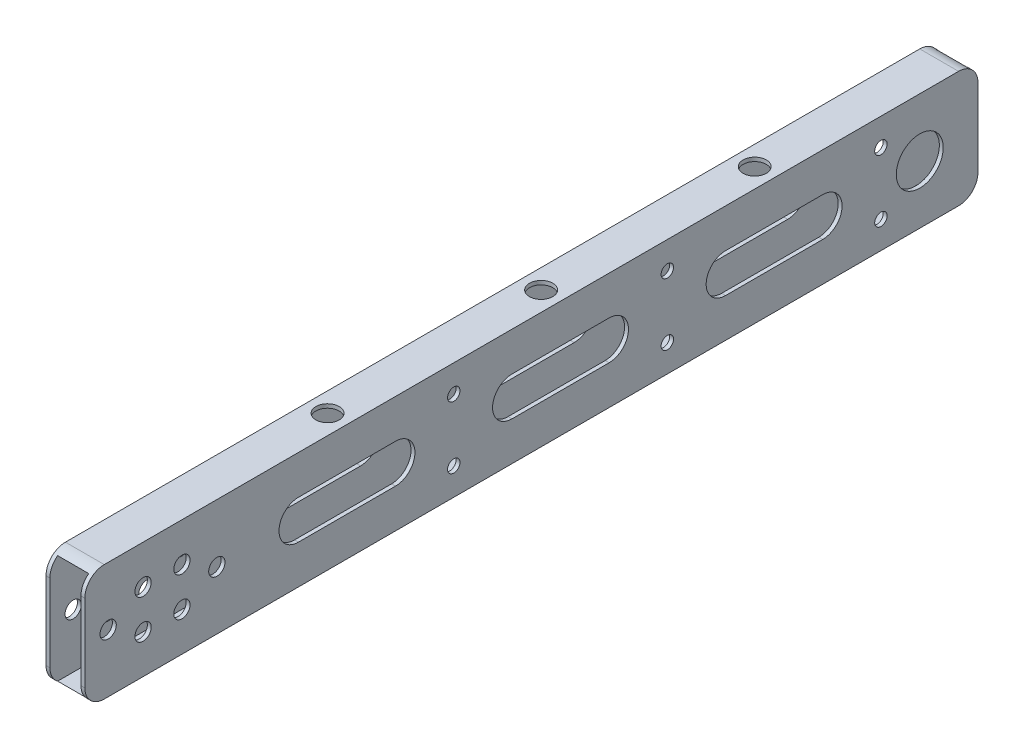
ISO-10303-21;
HEADER;
FILE_DESCRIPTION(('STEP AP214'),'2;1');
FILE_NAME('part.step','',(''),(''),'','','');
FILE_SCHEMA(('AUTOMOTIVE_DESIGN { 1 0 10303 214 1 1 1 1 }'));
ENDSEC;
DATA;
#1=APPLICATION_CONTEXT('core data for automotive mechanical design processes');
#2=APPLICATION_PROTOCOL_DEFINITION('international standard','automotive_design',2000,#1);
#3=PRODUCT_CONTEXT('',#1,'mechanical');
#4=PRODUCT('Part','Part','',(#3));
#5=PRODUCT_RELATED_PRODUCT_CATEGORY('part','',(#4));
#6=PRODUCT_DEFINITION_FORMATION('','',#4);
#7=PRODUCT_DEFINITION_CONTEXT('part definition',#1,'design');
#8=PRODUCT_DEFINITION('design','',#6,#7);
#9=PRODUCT_DEFINITION_SHAPE('','',#8);
#10=(LENGTH_UNIT() NAMED_UNIT(*) SI_UNIT(.MILLI.,.METRE.));
#11=(NAMED_UNIT(*) PLANE_ANGLE_UNIT() SI_UNIT($,.RADIAN.));
#12=(NAMED_UNIT(*) SI_UNIT($,.STERADIAN.) SOLID_ANGLE_UNIT());
#13=UNCERTAINTY_MEASURE_WITH_UNIT(LENGTH_MEASURE(1.E-05),#10,'distance_accuracy_value','');
#14=(GEOMETRIC_REPRESENTATION_CONTEXT(3) GLOBAL_UNCERTAINTY_ASSIGNED_CONTEXT((#13)) GLOBAL_UNIT_ASSIGNED_CONTEXT((#10,
#11,#12)) REPRESENTATION_CONTEXT('',''));
#15=CARTESIAN_POINT('',(0.,0.,0.));
#16=DIRECTION('',(0.,0.,1.));
#17=DIRECTION('',(1.,0.,0.));
#18=AXIS2_PLACEMENT_3D('',#15,#16,#17);
#19=CARTESIAN_POINT('',(-5.,-5.,65.));
#20=DIRECTION('',(0.,-1.,0.));
#21=DIRECTION('',(0.,0.,-1.));
#22=AXIS2_PLACEMENT_3D('',#19,#20,#21);
#23=PLANE('',#22);
#24=DIRECTION('',(0.,0.,-1.));
#25=VECTOR('',#24,1.);
#26=CARTESIAN_POINT('',(-4.,-5.,230.));
#27=LINE('',#26,#25);
#28=CARTESIAN_POINT('',(-4.,-5.,65.));
#29=VERTEX_POINT('',#28);
#30=CARTESIAN_POINT('',(-4.,-5.,40.));
#31=VERTEX_POINT('',#30);
#32=EDGE_CURVE('E473',#29,#31,#27,.T.);
#33=ORIENTED_EDGE('',*,*,#32,.T.);
#34=DIRECTION('',(1.,0.,0.));
#35=VECTOR('',#34,1.);
#36=CARTESIAN_POINT('',(-5.,-5.,40.));
#37=LINE('',#36,#35);
#38=CARTESIAN_POINT('',(-5.,-5.,40.));
#39=VERTEX_POINT('',#38);
#40=EDGE_CURVE('E11',#39,#31,#37,.T.);
#41=ORIENTED_EDGE('',*,*,#40,.F.);
#42=DIRECTION('',(0.,0.,-1.));
#43=VECTOR('',#42,1.);
#44=CARTESIAN_POINT('',(-5.,-5.,65.));
#45=LINE('',#44,#43);
#46=CARTESIAN_POINT('',(-5.,-5.,65.));
#47=VERTEX_POINT('',#46);
#48=EDGE_CURVE('E441',#47,#39,#45,.T.);
#49=ORIENTED_EDGE('',*,*,#48,.F.);
#50=DIRECTION('',(1.,0.,0.));
#51=VECTOR('',#50,1.);
#52=CARTESIAN_POINT('',(-5.,-5.,65.));
#53=LINE('',#52,#51);
#54=EDGE_CURVE('E618',#47,#29,#53,.T.);
#55=ORIENTED_EDGE('',*,*,#54,.T.);
#56=EDGE_LOOP('',(#33,#41,#49,#55));
#57=FACE_BOUND('',#56,.T.);
#58=ADVANCED_FACE('F17',(#57),#23,.F.);
#59=CARTESIAN_POINT('',(-5.,5.,65.));
#60=DIRECTION('',(0.,-1.,0.));
#61=DIRECTION('',(0.,0.,-1.));
#62=AXIS2_PLACEMENT_3D('',#59,#60,#61);
#63=PLANE('',#62);
#64=DIRECTION('',(1.,0.,0.));
#65=VECTOR('',#64,1.);
#66=CARTESIAN_POINT('',(-5.,5.,65.));
#67=LINE('',#66,#65);
#68=CARTESIAN_POINT('',(-5.,5.,65.));
#69=VERTEX_POINT('',#68);
#70=CARTESIAN_POINT('',(-4.,5.,65.));
#71=VERTEX_POINT('',#70);
#72=EDGE_CURVE('E21',#69,#71,#67,.T.);
#73=ORIENTED_EDGE('',*,*,#72,.F.);
#74=DIRECTION('',(0.,0.,-1.));
#75=VECTOR('',#74,1.);
#76=CARTESIAN_POINT('',(-5.,5.,65.));
#77=LINE('',#76,#75);
#78=CARTESIAN_POINT('',(-5.,5.,40.));
#79=VERTEX_POINT('',#78);
#80=EDGE_CURVE('E424',#69,#79,#77,.T.);
#81=ORIENTED_EDGE('',*,*,#80,.T.);
#82=DIRECTION('',(1.,0.,0.));
#83=VECTOR('',#82,1.);
#84=CARTESIAN_POINT('',(-5.,5.,40.));
#85=LINE('',#84,#83);
#86=CARTESIAN_POINT('',(-4.,5.,40.));
#87=VERTEX_POINT('',#86);
#88=EDGE_CURVE('E688',#79,#87,#85,.T.);
#89=ORIENTED_EDGE('',*,*,#88,.T.);
#90=DIRECTION('',(0.,0.,-1.));
#91=VECTOR('',#90,1.);
#92=CARTESIAN_POINT('',(-4.,5.,230.));
#93=LINE('',#92,#91);
#94=EDGE_CURVE('E470',#71,#87,#93,.T.);
#95=ORIENTED_EDGE('',*,*,#94,.F.);
#96=EDGE_LOOP('',(#73,#81,#89,#95));
#97=FACE_BOUND('',#96,.T.);
#98=ADVANCED_FACE('F19',(#97),#63,.T.);
#99=CARTESIAN_POINT('',(-5.,0.,65.));
#100=DIRECTION('',(1.,0.,0.));
#101=DIRECTION('',(0.,0.,-1.));
#102=AXIS2_PLACEMENT_3D('',#99,#100,#101);
#103=CYLINDRICAL_SURFACE('',#102,5.);
#104=CARTESIAN_POINT('',(-4.,0.,65.));
#105=DIRECTION('',(1.,0.,0.));
#106=DIRECTION('',(0.,1.,0.));
#107=AXIS2_PLACEMENT_3D('',#104,#105,#106);
#108=CIRCLE('',#107,5.);
#109=EDGE_CURVE('E465',#71,#29,#108,.T.);
#110=ORIENTED_EDGE('',*,*,#109,.T.);
#111=ORIENTED_EDGE('',*,*,#54,.F.);
#112=CARTESIAN_POINT('',(-5.,0.,65.));
#113=DIRECTION('',(1.,0.,0.));
#114=DIRECTION('',(0.,0.,-1.));
#115=AXIS2_PLACEMENT_3D('',#112,#113,#114);
#116=CIRCLE('',#115,5.);
#117=EDGE_CURVE('E427',#69,#47,#116,.T.);
#118=ORIENTED_EDGE('',*,*,#117,.F.);
#119=ORIENTED_EDGE('',*,*,#72,.T.);
#120=EDGE_LOOP('',(#110,#111,#118,#119));
#121=FACE_BOUND('',#120,.T.);
#122=ADVANCED_FACE('F1041',(#121),#103,.F.);
#123=CARTESIAN_POINT('',(-5.,-5.,120.));
#124=DIRECTION('',(0.,-1.,0.));
#125=DIRECTION('',(0.,0.,-1.));
#126=AXIS2_PLACEMENT_3D('',#123,#124,#125);
#127=PLANE('',#126);
#128=DIRECTION('',(0.,0.,-1.));
#129=VECTOR('',#128,1.);
#130=CARTESIAN_POINT('',(-4.,-5.,230.));
#131=LINE('',#130,#129);
#132=CARTESIAN_POINT('',(-4.,-5.,120.));
#133=VERTEX_POINT('',#132);
#134=CARTESIAN_POINT('',(-4.,-5.,95.));
#135=VERTEX_POINT('',#134);
#136=EDGE_CURVE('E484',#133,#135,#131,.T.);
#137=ORIENTED_EDGE('',*,*,#136,.T.);
#138=DIRECTION('',(1.,0.,0.));
#139=VECTOR('',#138,1.);
#140=CARTESIAN_POINT('',(-5.,-5.,95.));
#141=LINE('',#140,#139);
#142=CARTESIAN_POINT('',(-5.,-5.,95.));
#143=VERTEX_POINT('',#142);
#144=EDGE_CURVE('E617',#143,#135,#141,.T.);
#145=ORIENTED_EDGE('',*,*,#144,.F.);
#146=DIRECTION('',(0.,0.,-1.));
#147=VECTOR('',#146,1.);
#148=CARTESIAN_POINT('',(-5.,-5.,120.));
#149=LINE('',#148,#147);
#150=CARTESIAN_POINT('',(-5.,-5.,120.));
#151=VERTEX_POINT('',#150);
#152=EDGE_CURVE('E428',#151,#143,#149,.T.);
#153=ORIENTED_EDGE('',*,*,#152,.F.);
#154=DIRECTION('',(1.,0.,0.));
#155=VECTOR('',#154,1.);
#156=CARTESIAN_POINT('',(-5.,-5.,120.));
#157=LINE('',#156,#155);
#158=EDGE_CURVE('E612',#151,#133,#157,.T.);
#159=ORIENTED_EDGE('',*,*,#158,.T.);
#160=EDGE_LOOP('',(#137,#145,#153,#159));
#161=FACE_BOUND('',#160,.T.);
#162=ADVANCED_FACE('F1054',(#161),#127,.F.);
#163=CARTESIAN_POINT('',(-5.,5.,120.));
#164=DIRECTION('',(0.,-1.,0.));
#165=DIRECTION('',(0.,0.,-1.));
#166=AXIS2_PLACEMENT_3D('',#163,#164,#165);
#167=PLANE('',#166);
#168=DIRECTION('',(1.,0.,0.));
#169=VECTOR('',#168,1.);
#170=CARTESIAN_POINT('',(-5.,5.,120.));
#171=LINE('',#170,#169);
#172=CARTESIAN_POINT('',(-5.,5.,120.));
#173=VERTEX_POINT('',#172);
#174=CARTESIAN_POINT('',(-4.,5.,120.));
#175=VERTEX_POINT('',#174);
#176=EDGE_CURVE('E615',#173,#175,#171,.T.);
#177=ORIENTED_EDGE('',*,*,#176,.F.);
#178=DIRECTION('',(0.,0.,-1.));
#179=VECTOR('',#178,1.);
#180=CARTESIAN_POINT('',(-5.,5.,120.));
#181=LINE('',#180,#179);
#182=CARTESIAN_POINT('',(-5.,5.,95.));
#183=VERTEX_POINT('',#182);
#184=EDGE_CURVE('E423',#173,#183,#181,.T.);
#185=ORIENTED_EDGE('',*,*,#184,.T.);
#186=DIRECTION('',(1.,0.,0.));
#187=VECTOR('',#186,1.);
#188=CARTESIAN_POINT('',(-5.,5.,95.));
#189=LINE('',#188,#187);
#190=CARTESIAN_POINT('',(-4.,5.,95.));
#191=VERTEX_POINT('',#190);
#192=EDGE_CURVE('E682',#183,#191,#189,.T.);
#193=ORIENTED_EDGE('',*,*,#192,.T.);
#194=DIRECTION('',(0.,0.,-1.));
#195=VECTOR('',#194,1.);
#196=CARTESIAN_POINT('',(-4.,5.,230.));
#197=LINE('',#196,#195);
#198=EDGE_CURVE('E481',#175,#191,#197,.T.);
#199=ORIENTED_EDGE('',*,*,#198,.F.);
#200=EDGE_LOOP('',(#177,#185,#193,#199));
#201=FACE_BOUND('',#200,.T.);
#202=ADVANCED_FACE('F1170',(#201),#167,.T.);
#203=CARTESIAN_POINT('',(-5.,0.,120.));
#204=DIRECTION('',(1.,0.,0.));
#205=DIRECTION('',(0.,0.,-1.));
#206=AXIS2_PLACEMENT_3D('',#203,#204,#205);
#207=CYLINDRICAL_SURFACE('',#206,5.);
#208=CARTESIAN_POINT('',(-4.,0.,120.));
#209=DIRECTION('',(1.,0.,0.));
#210=DIRECTION('',(0.,1.,0.));
#211=AXIS2_PLACEMENT_3D('',#208,#209,#210);
#212=CIRCLE('',#211,5.);
#213=EDGE_CURVE('E477',#175,#133,#212,.T.);
#214=ORIENTED_EDGE('',*,*,#213,.T.);
#215=ORIENTED_EDGE('',*,*,#158,.F.);
#216=CARTESIAN_POINT('',(-5.,0.,120.));
#217=DIRECTION('',(1.,0.,0.));
#218=DIRECTION('',(0.,0.,-1.));
#219=AXIS2_PLACEMENT_3D('',#216,#217,#218);
#220=CIRCLE('',#219,5.);
#221=EDGE_CURVE('E431',#173,#151,#220,.T.);
#222=ORIENTED_EDGE('',*,*,#221,.F.);
#223=ORIENTED_EDGE('',*,*,#176,.T.);
#224=EDGE_LOOP('',(#214,#215,#222,#223));
#225=FACE_BOUND('',#224,.T.);
#226=ADVANCED_FACE('F1074',(#225),#207,.F.);
#227=CARTESIAN_POINT('',(-5.,-5.,175.));
#228=DIRECTION('',(0.,-1.,0.));
#229=DIRECTION('',(0.,0.,-1.));
#230=AXIS2_PLACEMENT_3D('',#227,#228,#229);
#231=PLANE('',#230);
#232=DIRECTION('',(0.,0.,-1.));
#233=VECTOR('',#232,1.);
#234=CARTESIAN_POINT('',(-4.,-5.,230.));
#235=LINE('',#234,#233);
#236=CARTESIAN_POINT('',(-4.,-5.,175.));
#237=VERTEX_POINT('',#236);
#238=CARTESIAN_POINT('',(-4.,-5.,150.));
#239=VERTEX_POINT('',#238);
#240=EDGE_CURVE('E498',#237,#239,#235,.T.);
#241=ORIENTED_EDGE('',*,*,#240,.T.);
#242=DIRECTION('',(1.,0.,0.));
#243=VECTOR('',#242,1.);
#244=CARTESIAN_POINT('',(-5.,-5.,150.));
#245=LINE('',#244,#243);
#246=CARTESIAN_POINT('',(-5.,-5.,150.));
#247=VERTEX_POINT('',#246);
#248=EDGE_CURVE('E608',#247,#239,#245,.T.);
#249=ORIENTED_EDGE('',*,*,#248,.F.);
#250=DIRECTION('',(0.,0.,-1.));
#251=VECTOR('',#250,1.);
#252=CARTESIAN_POINT('',(-5.,-5.,175.));
#253=LINE('',#252,#251);
#254=CARTESIAN_POINT('',(-5.,-5.,175.));
#255=VERTEX_POINT('',#254);
#256=EDGE_CURVE('E419',#255,#247,#253,.T.);
#257=ORIENTED_EDGE('',*,*,#256,.F.);
#258=DIRECTION('',(1.,0.,0.));
#259=VECTOR('',#258,1.);
#260=CARTESIAN_POINT('',(-5.,-5.,175.));
#261=LINE('',#260,#259);
#262=EDGE_CURVE('E601',#255,#237,#261,.T.);
#263=ORIENTED_EDGE('',*,*,#262,.T.);
#264=EDGE_LOOP('',(#241,#249,#257,#263));
#265=FACE_BOUND('',#264,.T.);
#266=ADVANCED_FACE('F1070',(#265),#231,.F.);
#267=CARTESIAN_POINT('',(-5.,5.,175.));
#268=DIRECTION('',(0.,-1.,0.));
#269=DIRECTION('',(0.,0.,-1.));
#270=AXIS2_PLACEMENT_3D('',#267,#268,#269);
#271=PLANE('',#270);
#272=DIRECTION('',(1.,0.,0.));
#273=VECTOR('',#272,1.);
#274=CARTESIAN_POINT('',(-5.,5.,175.));
#275=LINE('',#274,#273);
#276=CARTESIAN_POINT('',(-5.,5.,175.));
#277=VERTEX_POINT('',#276);
#278=CARTESIAN_POINT('',(-4.,5.,175.));
#279=VERTEX_POINT('',#278);
#280=EDGE_CURVE('E604',#277,#279,#275,.T.);
#281=ORIENTED_EDGE('',*,*,#280,.F.);
#282=DIRECTION('',(0.,0.,-1.));
#283=VECTOR('',#282,1.);
#284=CARTESIAN_POINT('',(-5.,5.,175.));
#285=LINE('',#284,#283);
#286=CARTESIAN_POINT('',(-5.,5.,150.));
#287=VERTEX_POINT('',#286);
#288=EDGE_CURVE('E409',#277,#287,#285,.T.);
#289=ORIENTED_EDGE('',*,*,#288,.T.);
#290=DIRECTION('',(1.,0.,0.));
#291=VECTOR('',#290,1.);
#292=CARTESIAN_POINT('',(-5.,5.,150.));
#293=LINE('',#292,#291);
#294=CARTESIAN_POINT('',(-4.,5.,150.));
#295=VERTEX_POINT('',#294);
#296=EDGE_CURVE('E657',#287,#295,#293,.T.);
#297=ORIENTED_EDGE('',*,*,#296,.T.);
#298=DIRECTION('',(0.,0.,-1.));
#299=VECTOR('',#298,1.);
#300=CARTESIAN_POINT('',(-4.,5.,230.));
#301=LINE('',#300,#299);
#302=EDGE_CURVE('E495',#279,#295,#301,.T.);
#303=ORIENTED_EDGE('',*,*,#302,.F.);
#304=EDGE_LOOP('',(#281,#289,#297,#303));
#305=FACE_BOUND('',#304,.T.);
#306=ADVANCED_FACE('F1073',(#305),#271,.T.);
#307=CARTESIAN_POINT('',(-5.,0.,175.));
#308=DIRECTION('',(1.,0.,0.));
#309=DIRECTION('',(0.,0.,-1.));
#310=AXIS2_PLACEMENT_3D('',#307,#308,#309);
#311=CYLINDRICAL_SURFACE('',#310,5.);
#312=CARTESIAN_POINT('',(-4.,0.,175.));
#313=DIRECTION('',(1.,0.,0.));
#314=DIRECTION('',(0.,1.,0.));
#315=AXIS2_PLACEMENT_3D('',#312,#313,#314);
#316=CIRCLE('',#315,5.);
#317=EDGE_CURVE('E494',#279,#237,#316,.T.);
#318=ORIENTED_EDGE('',*,*,#317,.T.);
#319=ORIENTED_EDGE('',*,*,#262,.F.);
#320=CARTESIAN_POINT('',(-5.,0.,175.));
#321=DIRECTION('',(1.,0.,0.));
#322=DIRECTION('',(0.,0.,-1.));
#323=AXIS2_PLACEMENT_3D('',#320,#321,#322);
#324=CIRCLE('',#323,5.);
#325=EDGE_CURVE('E415',#277,#255,#324,.T.);
#326=ORIENTED_EDGE('',*,*,#325,.F.);
#327=ORIENTED_EDGE('',*,*,#280,.T.);
#328=EDGE_LOOP('',(#318,#319,#326,#327));
#329=FACE_BOUND('',#328,.T.);
#330=ADVANCED_FACE('F1161',(#329),#311,.F.);
#331=CARTESIAN_POINT('',(-5.,0.,65.));
#332=DIRECTION('',(1.,0.,0.));
#333=DIRECTION('',(0.,0.,-1.));
#334=AXIS2_PLACEMENT_3D('',#331,#332,#333);
#335=CYLINDRICAL_SURFACE('',#334,5.);
#336=CARTESIAN_POINT('',(4.,0.,65.));
#337=DIRECTION('',(-1.,0.,0.));
#338=DIRECTION('',(0.,-1.,0.));
#339=AXIS2_PLACEMENT_3D('',#336,#337,#338);
#340=CIRCLE('',#339,5.);
#341=CARTESIAN_POINT('',(4.,-5.,65.));
#342=VERTEX_POINT('',#341);
#343=CARTESIAN_POINT('',(4.,5.,65.));
#344=VERTEX_POINT('',#343);
#345=EDGE_CURVE('E490',#342,#344,#340,.T.);
#346=ORIENTED_EDGE('',*,*,#345,.T.);
#347=DIRECTION('',(1.,0.,0.));
#348=VECTOR('',#347,1.);
#349=CARTESIAN_POINT('',(-5.,5.,65.));
#350=LINE('',#349,#348);
#351=CARTESIAN_POINT('',(5.,5.,65.));
#352=VERTEX_POINT('',#351);
#353=EDGE_CURVE('E605',#344,#352,#350,.T.);
#354=ORIENTED_EDGE('',*,*,#353,.T.);
#355=CARTESIAN_POINT('',(5.,0.,65.));
#356=DIRECTION('',(1.,0.,0.));
#357=DIRECTION('',(0.,0.,-1.));
#358=AXIS2_PLACEMENT_3D('',#355,#356,#357);
#359=CIRCLE('',#358,5.);
#360=CARTESIAN_POINT('',(5.,-5.,65.));
#361=VERTEX_POINT('',#360);
#362=EDGE_CURVE('E914',#352,#361,#359,.T.);
#363=ORIENTED_EDGE('',*,*,#362,.T.);
#364=DIRECTION('',(1.,0.,0.));
#365=VECTOR('',#364,1.);
#366=CARTESIAN_POINT('',(-5.,-5.,65.));
#367=LINE('',#366,#365);
#368=EDGE_CURVE('E596',#342,#361,#367,.T.);
#369=ORIENTED_EDGE('',*,*,#368,.F.);
#370=EDGE_LOOP('',(#346,#354,#363,#369));
#371=FACE_BOUND('',#370,.T.);
#372=ADVANCED_FACE('F1157',(#371),#335,.F.);
#373=CARTESIAN_POINT('',(-5.,5.,65.));
#374=DIRECTION('',(0.,-1.,0.));
#375=DIRECTION('',(0.,0.,-1.));
#376=AXIS2_PLACEMENT_3D('',#373,#374,#375);
#377=PLANE('',#376);
#378=DIRECTION('',(1.,0.,0.));
#379=VECTOR('',#378,1.);
#380=CARTESIAN_POINT('',(-5.,5.,40.));
#381=LINE('',#380,#379);
#382=CARTESIAN_POINT('',(4.,5.,40.));
#383=VERTEX_POINT('',#382);
#384=CARTESIAN_POINT('',(5.,5.,40.));
#385=VERTEX_POINT('',#384);
#386=EDGE_CURVE('E738',#383,#385,#381,.T.);
#387=ORIENTED_EDGE('',*,*,#386,.T.);
#388=DIRECTION('',(0.,0.,-1.));
#389=VECTOR('',#388,1.);
#390=CARTESIAN_POINT('',(5.,5.,65.));
#391=LINE('',#390,#389);
#392=EDGE_CURVE('E772',#352,#385,#391,.T.);
#393=ORIENTED_EDGE('',*,*,#392,.F.);
#394=ORIENTED_EDGE('',*,*,#353,.F.);
#395=DIRECTION('',(0.,0.,1.));
#396=VECTOR('',#395,1.);
#397=CARTESIAN_POINT('',(4.,5.,230.));
#398=LINE('',#397,#396);
#399=EDGE_CURVE('E489',#383,#344,#398,.T.);
#400=ORIENTED_EDGE('',*,*,#399,.F.);
#401=EDGE_LOOP('',(#387,#393,#394,#400));
#402=FACE_BOUND('',#401,.T.);
#403=ADVANCED_FACE('F1153',(#402),#377,.T.);
#404=CARTESIAN_POINT('',(-5.,-5.,65.));
#405=DIRECTION('',(0.,-1.,0.));
#406=DIRECTION('',(0.,0.,-1.));
#407=AXIS2_PLACEMENT_3D('',#404,#405,#406);
#408=PLANE('',#407);
#409=DIRECTION('',(0.,0.,1.));
#410=VECTOR('',#409,1.);
#411=CARTESIAN_POINT('',(4.,-5.,230.));
#412=LINE('',#411,#410);
#413=CARTESIAN_POINT('',(4.,-5.,40.));
#414=VERTEX_POINT('',#413);
#415=EDGE_CURVE('E485',#414,#342,#412,.T.);
#416=ORIENTED_EDGE('',*,*,#415,.T.);
#417=ORIENTED_EDGE('',*,*,#368,.T.);
#418=DIRECTION('',(0.,0.,-1.));
#419=VECTOR('',#418,1.);
#420=CARTESIAN_POINT('',(5.,-5.,65.));
#421=LINE('',#420,#419);
#422=CARTESIAN_POINT('',(5.,-5.,40.));
#423=VERTEX_POINT('',#422);
#424=EDGE_CURVE('E910',#361,#423,#421,.T.);
#425=ORIENTED_EDGE('',*,*,#424,.T.);
#426=DIRECTION('',(1.,0.,0.));
#427=VECTOR('',#426,1.);
#428=CARTESIAN_POINT('',(-5.,-5.,40.));
#429=LINE('',#428,#427);
#430=EDGE_CURVE('E600',#414,#423,#429,.T.);
#431=ORIENTED_EDGE('',*,*,#430,.F.);
#432=EDGE_LOOP('',(#416,#417,#425,#431));
#433=FACE_BOUND('',#432,.T.);
#434=ADVANCED_FACE('F1149',(#433),#408,.F.);
#435=CARTESIAN_POINT('',(-5.,0.,120.));
#436=DIRECTION('',(1.,0.,0.));
#437=DIRECTION('',(0.,0.,-1.));
#438=AXIS2_PLACEMENT_3D('',#435,#436,#437);
#439=CYLINDRICAL_SURFACE('',#438,5.);
#440=CARTESIAN_POINT('',(4.,0.,120.));
#441=DIRECTION('',(-1.,0.,0.));
#442=DIRECTION('',(0.,-1.,0.));
#443=AXIS2_PLACEMENT_3D('',#440,#441,#442);
#444=CIRCLE('',#443,5.);
#445=CARTESIAN_POINT('',(4.,-5.,120.));
#446=VERTEX_POINT('',#445);
#447=CARTESIAN_POINT('',(4.,5.,120.));
#448=VERTEX_POINT('',#447);
#449=EDGE_CURVE('E534',#446,#448,#444,.T.);
#450=ORIENTED_EDGE('',*,*,#449,.T.);
#451=DIRECTION('',(1.,0.,0.));
#452=VECTOR('',#451,1.);
#453=CARTESIAN_POINT('',(-5.,5.,120.));
#454=LINE('',#453,#452);
#455=CARTESIAN_POINT('',(5.,5.,120.));
#456=VERTEX_POINT('',#455);
#457=EDGE_CURVE('E581',#448,#456,#454,.T.);
#458=ORIENTED_EDGE('',*,*,#457,.T.);
#459=CARTESIAN_POINT('',(5.,0.,120.));
#460=DIRECTION('',(1.,0.,0.));
#461=DIRECTION('',(0.,0.,-1.));
#462=AXIS2_PLACEMENT_3D('',#459,#460,#461);
#463=CIRCLE('',#462,5.);
#464=CARTESIAN_POINT('',(5.,-5.,120.));
#465=VERTEX_POINT('',#464);
#466=EDGE_CURVE('E890',#456,#465,#463,.T.);
#467=ORIENTED_EDGE('',*,*,#466,.T.);
#468=DIRECTION('',(1.,0.,0.));
#469=VECTOR('',#468,1.);
#470=CARTESIAN_POINT('',(-5.,-5.,120.));
#471=LINE('',#470,#469);
#472=EDGE_CURVE('E582',#446,#465,#471,.T.);
#473=ORIENTED_EDGE('',*,*,#472,.F.);
#474=EDGE_LOOP('',(#450,#458,#467,#473));
#475=FACE_BOUND('',#474,.T.);
#476=ADVANCED_FACE('F1145',(#475),#439,.F.);
#477=CARTESIAN_POINT('',(-5.,5.,120.));
#478=DIRECTION('',(0.,-1.,0.));
#479=DIRECTION('',(0.,0.,-1.));
#480=AXIS2_PLACEMENT_3D('',#477,#478,#479);
#481=PLANE('',#480);
#482=DIRECTION('',(1.,0.,0.));
#483=VECTOR('',#482,1.);
#484=CARTESIAN_POINT('',(-5.,5.,95.));
#485=LINE('',#484,#483);
#486=CARTESIAN_POINT('',(4.,5.,95.));
#487=VERTEX_POINT('',#486);
#488=CARTESIAN_POINT('',(5.,5.,95.));
#489=VERTEX_POINT('',#488);
#490=EDGE_CURVE('E751',#487,#489,#485,.T.);
#491=ORIENTED_EDGE('',*,*,#490,.T.);
#492=DIRECTION('',(0.,0.,-1.));
#493=VECTOR('',#492,1.);
#494=CARTESIAN_POINT('',(5.,5.,120.));
#495=LINE('',#494,#493);
#496=EDGE_CURVE('E909',#456,#489,#495,.T.);
#497=ORIENTED_EDGE('',*,*,#496,.F.);
#498=ORIENTED_EDGE('',*,*,#457,.F.);
#499=DIRECTION('',(0.,0.,1.));
#500=VECTOR('',#499,1.);
#501=CARTESIAN_POINT('',(4.,5.,230.));
#502=LINE('',#501,#500);
#503=EDGE_CURVE('E503',#487,#448,#502,.T.);
#504=ORIENTED_EDGE('',*,*,#503,.F.);
#505=EDGE_LOOP('',(#491,#497,#498,#504));
#506=FACE_BOUND('',#505,.T.);
#507=ADVANCED_FACE('F1129',(#506),#481,.T.);
#508=CARTESIAN_POINT('',(-5.,-5.,120.));
#509=DIRECTION('',(0.,-1.,0.));
#510=DIRECTION('',(0.,0.,-1.));
#511=AXIS2_PLACEMENT_3D('',#508,#509,#510);
#512=PLANE('',#511);
#513=DIRECTION('',(0.,0.,1.));
#514=VECTOR('',#513,1.);
#515=CARTESIAN_POINT('',(4.,-5.,230.));
#516=LINE('',#515,#514);
#517=CARTESIAN_POINT('',(4.,-5.,95.));
#518=VERTEX_POINT('',#517);
#519=EDGE_CURVE('E508',#518,#446,#516,.T.);
#520=ORIENTED_EDGE('',*,*,#519,.T.);
#521=ORIENTED_EDGE('',*,*,#472,.T.);
#522=DIRECTION('',(0.,0.,-1.));
#523=VECTOR('',#522,1.);
#524=CARTESIAN_POINT('',(5.,-5.,120.));
#525=LINE('',#524,#523);
#526=CARTESIAN_POINT('',(5.,-5.,95.));
#527=VERTEX_POINT('',#526);
#528=EDGE_CURVE('E886',#465,#527,#525,.T.);
#529=ORIENTED_EDGE('',*,*,#528,.T.);
#530=DIRECTION('',(1.,0.,0.));
#531=VECTOR('',#530,1.);
#532=CARTESIAN_POINT('',(-5.,-5.,95.));
#533=LINE('',#532,#531);
#534=EDGE_CURVE('E577',#518,#527,#533,.T.);
#535=ORIENTED_EDGE('',*,*,#534,.F.);
#536=EDGE_LOOP('',(#520,#521,#529,#535));
#537=FACE_BOUND('',#536,.T.);
#538=ADVANCED_FACE('F1125',(#537),#512,.F.);
#539=CARTESIAN_POINT('',(-5.,0.,175.));
#540=DIRECTION('',(1.,0.,0.));
#541=DIRECTION('',(0.,0.,-1.));
#542=AXIS2_PLACEMENT_3D('',#539,#540,#541);
#543=CYLINDRICAL_SURFACE('',#542,5.);
#544=CARTESIAN_POINT('',(4.,0.,175.));
#545=DIRECTION('',(-1.,0.,0.));
#546=DIRECTION('',(0.,-1.,0.));
#547=AXIS2_PLACEMENT_3D('',#544,#545,#546);
#548=CIRCLE('',#547,5.);
#549=CARTESIAN_POINT('',(4.,-5.,175.));
#550=VERTEX_POINT('',#549);
#551=CARTESIAN_POINT('',(4.,5.,175.));
#552=VERTEX_POINT('',#551);
#553=EDGE_CURVE('E507',#550,#552,#548,.T.);
#554=ORIENTED_EDGE('',*,*,#553,.T.);
#555=DIRECTION('',(1.,0.,0.));
#556=VECTOR('',#555,1.);
#557=CARTESIAN_POINT('',(-5.,5.,175.));
#558=LINE('',#557,#556);
#559=CARTESIAN_POINT('',(5.,5.,175.));
#560=VERTEX_POINT('',#559);
#561=EDGE_CURVE('E51',#552,#560,#558,.T.);
#562=ORIENTED_EDGE('',*,*,#561,.T.);
#563=CARTESIAN_POINT('',(5.,0.,175.));
#564=DIRECTION('',(1.,0.,0.));
#565=DIRECTION('',(0.,0.,-1.));
#566=AXIS2_PLACEMENT_3D('',#563,#564,#565);
#567=CIRCLE('',#566,5.);
#568=CARTESIAN_POINT('',(5.,-5.,175.));
#569=VERTEX_POINT('',#568);
#570=EDGE_CURVE('E900',#560,#569,#567,.T.);
#571=ORIENTED_EDGE('',*,*,#570,.T.);
#572=DIRECTION('',(1.,0.,0.));
#573=VECTOR('',#572,1.);
#574=CARTESIAN_POINT('',(-5.,-5.,175.));
#575=LINE('',#574,#573);
#576=EDGE_CURVE('E585',#550,#569,#575,.T.);
#577=ORIENTED_EDGE('',*,*,#576,.F.);
#578=EDGE_LOOP('',(#554,#562,#571,#577));
#579=FACE_BOUND('',#578,.T.);
#580=ADVANCED_FACE('F1128',(#579),#543,.F.);
#581=CARTESIAN_POINT('',(-5.,5.,175.));
#582=DIRECTION('',(0.,-1.,0.));
#583=DIRECTION('',(0.,0.,-1.));
#584=AXIS2_PLACEMENT_3D('',#581,#582,#583);
#585=PLANE('',#584);
#586=DIRECTION('',(1.,0.,0.));
#587=VECTOR('',#586,1.);
#588=CARTESIAN_POINT('',(-5.,5.,150.));
#589=LINE('',#588,#587);
#590=CARTESIAN_POINT('',(4.,5.,150.));
#591=VERTEX_POINT('',#590);
#592=CARTESIAN_POINT('',(5.,5.,150.));
#593=VERTEX_POINT('',#592);
#594=EDGE_CURVE('E656',#591,#593,#589,.T.);
#595=ORIENTED_EDGE('',*,*,#594,.T.);
#596=DIRECTION('',(0.,0.,-1.));
#597=VECTOR('',#596,1.);
#598=CARTESIAN_POINT('',(5.,5.,175.));
#599=LINE('',#598,#597);
#600=EDGE_CURVE('E891',#560,#593,#599,.T.);
#601=ORIENTED_EDGE('',*,*,#600,.F.);
#602=ORIENTED_EDGE('',*,*,#561,.F.);
#603=DIRECTION('',(0.,0.,1.));
#604=VECTOR('',#603,1.);
#605=CARTESIAN_POINT('',(4.,5.,230.));
#606=LINE('',#605,#604);
#607=EDGE_CURVE('E542',#591,#552,#606,.T.);
#608=ORIENTED_EDGE('',*,*,#607,.F.);
#609=EDGE_LOOP('',(#595,#601,#602,#608));
#610=FACE_BOUND('',#609,.T.);
#611=ADVANCED_FACE('F1079',(#610),#585,.T.);
#612=CARTESIAN_POINT('',(-5.,-5.,175.));
#613=DIRECTION('',(0.,-1.,0.));
#614=DIRECTION('',(0.,0.,-1.));
#615=AXIS2_PLACEMENT_3D('',#612,#613,#614);
#616=PLANE('',#615);
#617=DIRECTION('',(0.,0.,1.));
#618=VECTOR('',#617,1.);
#619=CARTESIAN_POINT('',(4.,-5.,230.));
#620=LINE('',#619,#618);
#621=CARTESIAN_POINT('',(4.,-5.,150.));
#622=VERTEX_POINT('',#621);
#623=EDGE_CURVE('E541',#622,#550,#620,.T.);
#624=ORIENTED_EDGE('',*,*,#623,.T.);
#625=ORIENTED_EDGE('',*,*,#576,.T.);
#626=DIRECTION('',(0.,0.,-1.));
#627=VECTOR('',#626,1.);
#628=CARTESIAN_POINT('',(5.,-5.,175.));
#629=LINE('',#628,#627);
#630=CARTESIAN_POINT('',(5.,-5.,150.));
#631=VERTEX_POINT('',#630);
#632=EDGE_CURVE('E885',#569,#631,#629,.T.);
#633=ORIENTED_EDGE('',*,*,#632,.T.);
#634=DIRECTION('',(1.,0.,0.));
#635=VECTOR('',#634,1.);
#636=CARTESIAN_POINT('',(-5.,-5.,150.));
#637=LINE('',#636,#635);
#638=EDGE_CURVE('E588',#622,#631,#637,.T.);
#639=ORIENTED_EDGE('',*,*,#638,.F.);
#640=EDGE_LOOP('',(#624,#625,#633,#639));
#641=FACE_BOUND('',#640,.T.);
#642=ADVANCED_FACE('F1076',(#641),#616,.F.);
#643=CARTESIAN_POINT('',(0.,-10.,225.));
#644=DIRECTION('',(1.,0.,0.));
#645=DIRECTION('',(0.,0.,-1.));
#646=AXIS2_PLACEMENT_3D('',#643,#644,#645);
#647=CYLINDRICAL_SURFACE('',#646,5.);
#648=CARTESIAN_POINT('',(-5.,-10.,225.));
#649=DIRECTION('',(-1.,0.,0.));
#650=DIRECTION('',(0.,0.,-1.));
#651=AXIS2_PLACEMENT_3D('',#648,#649,#650);
#652=CIRCLE('',#651,5.);
#653=CARTESIAN_POINT('',(-5.,-15.,225.));
#654=VERTEX_POINT('',#653);
#655=CARTESIAN_POINT('',(-5.,-10.,230.));
#656=VERTEX_POINT('',#655);
#657=EDGE_CURVE('E371',#654,#656,#652,.T.);
#658=ORIENTED_EDGE('',*,*,#657,.F.);
#659=DIRECTION('',(-1.,0.,0.));
#660=VECTOR('',#659,1.);
#661=CARTESIAN_POINT('',(-5.,-15.,225.));
#662=LINE('',#661,#660);
#663=CARTESIAN_POINT('',(5.,-15.,225.));
#664=VERTEX_POINT('',#663);
#665=EDGE_CURVE('E566',#664,#654,#662,.T.);
#666=ORIENTED_EDGE('',*,*,#665,.F.);
#667=CARTESIAN_POINT('',(5.,-10.,225.));
#668=DIRECTION('',(1.,0.,0.));
#669=DIRECTION('',(0.,0.,1.));
#670=AXIS2_PLACEMENT_3D('',#667,#668,#669);
#671=CIRCLE('',#670,5.);
#672=CARTESIAN_POINT('',(5.,-10.,230.));
#673=VERTEX_POINT('',#672);
#674=EDGE_CURVE('E873',#673,#664,#671,.T.);
#675=ORIENTED_EDGE('',*,*,#674,.F.);
#676=DIRECTION('',(1.,0.,0.));
#677=VECTOR('',#676,1.);
#678=CARTESIAN_POINT('',(0.,-10.,230.));
#679=LINE('',#678,#677);
#680=CARTESIAN_POINT('',(4.,-10.,230.));
#681=VERTEX_POINT('',#680);
#682=EDGE_CURVE('E548',#681,#673,#679,.T.);
#683=ORIENTED_EDGE('',*,*,#682,.F.);
#684=CARTESIAN_POINT('',(4.,-10.,225.));
#685=DIRECTION('',(-1.,0.,0.));
#686=DIRECTION('',(0.,-1.,0.));
#687=AXIS2_PLACEMENT_3D('',#684,#685,#686);
#688=CIRCLE('',#687,5.);
#689=CARTESIAN_POINT('',(4.,-14.,228.));
#690=VERTEX_POINT('',#689);
#691=EDGE_CURVE('E522',#690,#681,#688,.T.);
#692=ORIENTED_EDGE('',*,*,#691,.F.);
#693=DIRECTION('',(1.,0.,0.));
#694=VECTOR('',#693,1.);
#695=CARTESIAN_POINT('',(-4.,-14.,228.));
#696=LINE('',#695,#694);
#697=CARTESIAN_POINT('',(-4.,-14.,228.));
#698=VERTEX_POINT('',#697);
#699=EDGE_CURVE('E572',#698,#690,#696,.T.);
#700=ORIENTED_EDGE('',*,*,#699,.F.);
#701=CARTESIAN_POINT('',(-4.,-10.,225.));
#702=DIRECTION('',(1.,0.,0.));
#703=DIRECTION('',(0.,1.,0.));
#704=AXIS2_PLACEMENT_3D('',#701,#702,#703);
#705=CIRCLE('',#704,5.);
#706=CARTESIAN_POINT('',(-4.,-10.,230.));
#707=VERTEX_POINT('',#706);
#708=EDGE_CURVE('E374',#707,#698,#705,.T.);
#709=ORIENTED_EDGE('',*,*,#708,.F.);
#710=DIRECTION('',(1.,0.,0.));
#711=VECTOR('',#710,1.);
#712=CARTESIAN_POINT('',(0.,-10.,230.));
#713=LINE('',#712,#711);
#714=EDGE_CURVE('E367',#656,#707,#713,.T.);
#715=ORIENTED_EDGE('',*,*,#714,.F.);
#716=EDGE_LOOP('',(#658,#666,#675,#683,#692,#700,#709,#715));
#717=FACE_BOUND('',#716,.T.);
#718=ADVANCED_FACE('F369',(#717),#647,.T.);
#719=CARTESIAN_POINT('',(0.,10.,225.));
#720=DIRECTION('',(-1.,0.,0.));
#721=DIRECTION('',(0.,0.,1.));
#722=AXIS2_PLACEMENT_3D('',#719,#720,#721);
#723=CYLINDRICAL_SURFACE('',#722,5.);
#724=CARTESIAN_POINT('',(5.,10.,225.));
#725=DIRECTION('',(1.,0.,0.));
#726=DIRECTION('',(0.,0.,1.));
#727=AXIS2_PLACEMENT_3D('',#724,#725,#726);
#728=CIRCLE('',#727,5.);
#729=CARTESIAN_POINT('',(5.,15.,225.));
#730=VERTEX_POINT('',#729);
#731=CARTESIAN_POINT('',(5.,10.,230.));
#732=VERTEX_POINT('',#731);
#733=EDGE_CURVE('E868',#730,#732,#728,.T.);
#734=ORIENTED_EDGE('',*,*,#733,.F.);
#735=DIRECTION('',(1.,0.,0.));
#736=VECTOR('',#735,1.);
#737=CARTESIAN_POINT('',(-5.,15.,225.));
#738=LINE('',#737,#736);
#739=CARTESIAN_POINT('',(-5.,15.,225.));
#740=VERTEX_POINT('',#739);
#741=EDGE_CURVE('E560',#740,#730,#738,.T.);
#742=ORIENTED_EDGE('',*,*,#741,.F.);
#743=CARTESIAN_POINT('',(-5.,10.,225.));
#744=DIRECTION('',(-1.,0.,0.));
#745=DIRECTION('',(0.,0.,-1.));
#746=AXIS2_PLACEMENT_3D('',#743,#744,#745);
#747=CIRCLE('',#746,5.);
#748=CARTESIAN_POINT('',(-5.,10.,230.));
#749=VERTEX_POINT('',#748);
#750=EDGE_CURVE('E389',#749,#740,#747,.T.);
#751=ORIENTED_EDGE('',*,*,#750,.F.);
#752=DIRECTION('',(-1.,0.,0.));
#753=VECTOR('',#752,1.);
#754=CARTESIAN_POINT('',(0.,10.,230.));
#755=LINE('',#754,#753);
#756=CARTESIAN_POINT('',(-4.,10.,230.));
#757=VERTEX_POINT('',#756);
#758=EDGE_CURVE('E380',#757,#749,#755,.T.);
#759=ORIENTED_EDGE('',*,*,#758,.F.);
#760=CARTESIAN_POINT('',(-4.,10.,225.));
#761=DIRECTION('',(1.,0.,0.));
#762=DIRECTION('',(0.,1.,0.));
#763=AXIS2_PLACEMENT_3D('',#760,#761,#762);
#764=CIRCLE('',#763,5.);
#765=CARTESIAN_POINT('',(-4.,14.,228.));
#766=VERTEX_POINT('',#765);
#767=EDGE_CURVE('E454',#766,#757,#764,.T.);
#768=ORIENTED_EDGE('',*,*,#767,.F.);
#769=DIRECTION('',(-1.,0.,0.));
#770=VECTOR('',#769,1.);
#771=CARTESIAN_POINT('',(4.,14.,228.));
#772=LINE('',#771,#770);
#773=CARTESIAN_POINT('',(4.,14.,228.));
#774=VERTEX_POINT('',#773);
#775=EDGE_CURVE('E576',#774,#766,#772,.T.);
#776=ORIENTED_EDGE('',*,*,#775,.F.);
#777=CARTESIAN_POINT('',(4.,10.,225.));
#778=DIRECTION('',(-1.,0.,0.));
#779=DIRECTION('',(0.,-1.,0.));
#780=AXIS2_PLACEMENT_3D('',#777,#778,#779);
#781=CIRCLE('',#780,5.);
#782=CARTESIAN_POINT('',(4.,10.,230.));
#783=VERTEX_POINT('',#782);
#784=EDGE_CURVE('E530',#783,#774,#781,.T.);
#785=ORIENTED_EDGE('',*,*,#784,.F.);
#786=DIRECTION('',(-1.,0.,0.));
#787=VECTOR('',#786,1.);
#788=CARTESIAN_POINT('',(0.,10.,230.));
#789=LINE('',#788,#787);
#790=EDGE_CURVE('E545',#732,#783,#789,.T.);
#791=ORIENTED_EDGE('',*,*,#790,.F.);
#792=EDGE_LOOP('',(#734,#742,#751,#759,#768,#776,#785,#791));
#793=FACE_BOUND('',#792,.T.);
#794=ADVANCED_FACE('F1108',(#793),#723,.T.);
#795=CARTESIAN_POINT('',(-5.,-10.,5.));
#796=DIRECTION('',(-1.,0.,0.));
#797=DIRECTION('',(0.,0.,1.));
#798=AXIS2_PLACEMENT_3D('',#795,#796,#797);
#799=CYLINDRICAL_SURFACE('',#798,5.);
#800=CARTESIAN_POINT('',(4.,-10.,5.));
#801=DIRECTION('',(-1.,0.,0.));
#802=DIRECTION('',(0.,-1.,0.));
#803=AXIS2_PLACEMENT_3D('',#800,#801,#802);
#804=CIRCLE('',#803,5.);
#805=CARTESIAN_POINT('',(4.,-10.,0.));
#806=VERTEX_POINT('',#805);
#807=CARTESIAN_POINT('',(4.,-14.,2.));
#808=VERTEX_POINT('',#807);
#809=EDGE_CURVE('E517',#806,#808,#804,.T.);
#810=ORIENTED_EDGE('',*,*,#809,.F.);
#811=DIRECTION('',(-1.,0.,0.));
#812=VECTOR('',#811,1.);
#813=CARTESIAN_POINT('',(-5.,-10.,0.));
#814=LINE('',#813,#812);
#815=CARTESIAN_POINT('',(5.,-10.,0.));
#816=VERTEX_POINT('',#815);
#817=EDGE_CURVE('E412',#816,#806,#814,.T.);
#818=ORIENTED_EDGE('',*,*,#817,.F.);
#819=CARTESIAN_POINT('',(5.,-10.,5.));
#820=DIRECTION('',(1.,0.,0.));
#821=DIRECTION('',(0.,0.,1.));
#822=AXIS2_PLACEMENT_3D('',#819,#820,#821);
#823=CIRCLE('',#822,5.);
#824=CARTESIAN_POINT('',(5.,-15.,5.));
#825=VERTEX_POINT('',#824);
#826=EDGE_CURVE('E881',#825,#816,#823,.T.);
#827=ORIENTED_EDGE('',*,*,#826,.F.);
#828=DIRECTION('',(1.,0.,0.));
#829=VECTOR('',#828,1.);
#830=CARTESIAN_POINT('',(5.,-15.,5.));
#831=LINE('',#830,#829);
#832=CARTESIAN_POINT('',(-5.,-15.,5.));
#833=VERTEX_POINT('',#832);
#834=EDGE_CURVE('E563',#833,#825,#831,.T.);
#835=ORIENTED_EDGE('',*,*,#834,.F.);
#836=CARTESIAN_POINT('',(-5.,-10.,5.));
#837=DIRECTION('',(-1.,0.,0.));
#838=DIRECTION('',(0.,0.,-1.));
#839=AXIS2_PLACEMENT_3D('',#836,#837,#838);
#840=CIRCLE('',#839,5.);
#841=CARTESIAN_POINT('',(-5.,-10.,0.));
#842=VERTEX_POINT('',#841);
#843=EDGE_CURVE('E402',#842,#833,#840,.T.);
#844=ORIENTED_EDGE('',*,*,#843,.F.);
#845=DIRECTION('',(-1.,0.,0.));
#846=VECTOR('',#845,1.);
#847=CARTESIAN_POINT('',(-5.,-10.,0.));
#848=LINE('',#847,#846);
#849=CARTESIAN_POINT('',(-4.,-10.,0.));
#850=VERTEX_POINT('',#849);
#851=EDGE_CURVE('E554',#850,#842,#848,.T.);
#852=ORIENTED_EDGE('',*,*,#851,.F.);
#853=CARTESIAN_POINT('',(-4.,-10.,5.));
#854=DIRECTION('',(1.,0.,0.));
#855=DIRECTION('',(0.,1.,0.));
#856=AXIS2_PLACEMENT_3D('',#853,#854,#855);
#857=CIRCLE('',#856,5.);
#858=CARTESIAN_POINT('',(-4.,-14.,2.));
#859=VERTEX_POINT('',#858);
#860=EDGE_CURVE('E461',#859,#850,#857,.T.);
#861=ORIENTED_EDGE('',*,*,#860,.F.);
#862=DIRECTION('',(-1.,0.,0.));
#863=VECTOR('',#862,1.);
#864=CARTESIAN_POINT('',(4.,-14.,2.));
#865=LINE('',#864,#863);
#866=EDGE_CURVE('E569',#808,#859,#865,.T.);
#867=ORIENTED_EDGE('',*,*,#866,.F.);
#868=EDGE_LOOP('',(#810,#818,#827,#835,#844,#852,#861,#867));
#869=FACE_BOUND('',#868,.T.);
#870=ADVANCED_FACE('F937',(#869),#799,.T.);
#871=CARTESIAN_POINT('',(-5.,10.,5.));
#872=DIRECTION('',(1.,0.,0.));
#873=DIRECTION('',(0.,0.,-1.));
#874=AXIS2_PLACEMENT_3D('',#871,#872,#873);
#875=CYLINDRICAL_SURFACE('',#874,5.);
#876=CARTESIAN_POINT('',(-4.,10.,5.));
#877=DIRECTION('',(1.,0.,0.));
#878=DIRECTION('',(0.,1.,0.));
#879=AXIS2_PLACEMENT_3D('',#876,#877,#878);
#880=CIRCLE('',#879,5.);
#881=CARTESIAN_POINT('',(-4.,10.,0.));
#882=VERTEX_POINT('',#881);
#883=CARTESIAN_POINT('',(-4.,14.,2.));
#884=VERTEX_POINT('',#883);
#885=EDGE_CURVE('E449',#882,#884,#880,.T.);
#886=ORIENTED_EDGE('',*,*,#885,.F.);
#887=DIRECTION('',(1.,0.,0.));
#888=VECTOR('',#887,1.);
#889=CARTESIAN_POINT('',(5.,10.,0.));
#890=LINE('',#889,#888);
#891=CARTESIAN_POINT('',(-5.,10.,0.));
#892=VERTEX_POINT('',#891);
#893=EDGE_CURVE('E551',#892,#882,#890,.T.);
#894=ORIENTED_EDGE('',*,*,#893,.F.);
#895=CARTESIAN_POINT('',(-5.,10.,5.));
#896=DIRECTION('',(-1.,0.,0.));
#897=DIRECTION('',(0.,0.,-1.));
#898=AXIS2_PLACEMENT_3D('',#895,#896,#897);
#899=CIRCLE('',#898,5.);
#900=CARTESIAN_POINT('',(-5.,15.,5.));
#901=VERTEX_POINT('',#900);
#902=EDGE_CURVE('E771',#901,#892,#899,.T.);
#903=ORIENTED_EDGE('',*,*,#902,.F.);
#904=DIRECTION('',(-1.,0.,0.));
#905=VECTOR('',#904,1.);
#906=CARTESIAN_POINT('',(-5.,15.,5.));
#907=LINE('',#906,#905);
#908=CARTESIAN_POINT('',(5.,15.,5.));
#909=VERTEX_POINT('',#908);
#910=EDGE_CURVE('E557',#909,#901,#907,.T.);
#911=ORIENTED_EDGE('',*,*,#910,.F.);
#912=CARTESIAN_POINT('',(5.,10.,5.));
#913=DIRECTION('',(1.,0.,0.));
#914=DIRECTION('',(0.,0.,1.));
#915=AXIS2_PLACEMENT_3D('',#912,#913,#914);
#916=CIRCLE('',#915,5.);
#917=CARTESIAN_POINT('',(5.,10.,0.));
#918=VERTEX_POINT('',#917);
#919=EDGE_CURVE('E860',#918,#909,#916,.T.);
#920=ORIENTED_EDGE('',*,*,#919,.F.);
#921=DIRECTION('',(1.,0.,0.));
#922=VECTOR('',#921,1.);
#923=CARTESIAN_POINT('',(5.,10.,0.));
#924=LINE('',#923,#922);
#925=CARTESIAN_POINT('',(4.,10.,0.));
#926=VERTEX_POINT('',#925);
#927=EDGE_CURVE('E379',#926,#918,#924,.T.);
#928=ORIENTED_EDGE('',*,*,#927,.F.);
#929=CARTESIAN_POINT('',(4.,10.,5.));
#930=DIRECTION('',(-1.,0.,0.));
#931=DIRECTION('',(0.,-1.,0.));
#932=AXIS2_PLACEMENT_3D('',#929,#930,#931);
#933=CIRCLE('',#932,5.);
#934=CARTESIAN_POINT('',(4.,14.,2.));
#935=VERTEX_POINT('',#934);
#936=EDGE_CURVE('E509',#935,#926,#933,.T.);
#937=ORIENTED_EDGE('',*,*,#936,.F.);
#938=DIRECTION('',(1.,0.,0.));
#939=VECTOR('',#938,1.);
#940=CARTESIAN_POINT('',(-4.,14.,2.));
#941=LINE('',#940,#939);
#942=EDGE_CURVE('E573',#884,#935,#941,.T.);
#943=ORIENTED_EDGE('',*,*,#942,.F.);
#944=EDGE_LOOP('',(#886,#894,#903,#911,#920,#928,#937,#943));
#945=FACE_BOUND('',#944,.T.);
#946=ADVANCED_FACE('F1097',(#945),#875,.T.);
#947=CARTESIAN_POINT('',(4.,14.,230.));
#948=DIRECTION('',(0.,-1.,0.));
#949=DIRECTION('',(0.,0.,-1.));
#950=AXIS2_PLACEMENT_3D('',#947,#948,#949);
#951=PLANE('',#950);
#952=CARTESIAN_POINT('',(0.,14.,162.5));
#953=DIRECTION('',(0.,-1.,0.));
#954=DIRECTION('',(1.,0.,0.));
#955=AXIS2_PLACEMENT_3D('',#952,#953,#954);
#956=CIRCLE('',#955,3.);
#957=CARTESIAN_POINT('',(3.,14.,162.5));
#958=VERTEX_POINT('',#957);
#959=EDGE_CURVE('E1420',#958,#958,#956,.T.);
#960=ORIENTED_EDGE('',*,*,#959,.F.);
#961=EDGE_LOOP('',(#960));
#962=FACE_BOUND('',#961,.T.);
#963=CARTESIAN_POINT('',(0.,14.,52.5));
#964=DIRECTION('',(0.,-1.,0.));
#965=DIRECTION('',(1.,0.,0.));
#966=AXIS2_PLACEMENT_3D('',#963,#964,#965);
#967=CIRCLE('',#966,3.);
#968=CARTESIAN_POINT('',(3.,14.,52.5));
#969=VERTEX_POINT('',#968);
#970=EDGE_CURVE('E1442',#969,#969,#967,.T.);
#971=ORIENTED_EDGE('',*,*,#970,.F.);
#972=EDGE_LOOP('',(#971));
#973=FACE_BOUND('',#972,.T.);
#974=CARTESIAN_POINT('',(0.,14.,107.5));
#975=DIRECTION('',(0.,-1.,0.));
#976=DIRECTION('',(1.,0.,0.));
#977=AXIS2_PLACEMENT_3D('',#974,#975,#976);
#978=CIRCLE('',#977,3.);
#979=CARTESIAN_POINT('',(3.,14.,107.5));
#980=VERTEX_POINT('',#979);
#981=EDGE_CURVE('E1462',#980,#980,#978,.T.);
#982=ORIENTED_EDGE('',*,*,#981,.F.);
#983=EDGE_LOOP('',(#982));
#984=FACE_BOUND('',#983,.T.);
#985=DIRECTION('',(0.,0.,-1.));
#986=VECTOR('',#985,1.);
#987=CARTESIAN_POINT('',(-4.,14.,230.));
#988=LINE('',#987,#986);
#989=EDGE_CURVE('E453',#766,#884,#988,.T.);
#990=ORIENTED_EDGE('',*,*,#989,.T.);
#991=ORIENTED_EDGE('',*,*,#942,.T.);
#992=DIRECTION('',(0.,0.,-1.));
#993=VECTOR('',#992,1.);
#994=CARTESIAN_POINT('',(4.,14.,230.));
#995=LINE('',#994,#993);
#996=EDGE_CURVE('E502',#774,#935,#995,.T.);
#997=ORIENTED_EDGE('',*,*,#996,.F.);
#998=ORIENTED_EDGE('',*,*,#775,.T.);
#999=EDGE_LOOP('',(#990,#991,#997,#998));
#1000=FACE_BOUND('',#999,.T.);
#1001=ADVANCED_FACE('F1093',(#962,#973,#984,#1000),#951,.T.);
#1002=CARTESIAN_POINT('',(4.,-14.,230.));
#1003=DIRECTION('',(0.,1.,0.));
#1004=DIRECTION('',(1.,0.,0.));
#1005=AXIS2_PLACEMENT_3D('',#1002,#1003,#1004);
#1006=PLANE('',#1005);
#1007=CARTESIAN_POINT('',(0.,-14.,162.5));
#1008=DIRECTION('',(0.,1.,0.));
#1009=DIRECTION('',(-1.,0.,0.));
#1010=AXIS2_PLACEMENT_3D('',#1007,#1008,#1009);
#1011=CIRCLE('',#1010,1.6);
#1012=CARTESIAN_POINT('',(-1.6,-14.,162.5));
#1013=VERTEX_POINT('',#1012);
#1014=EDGE_CURVE('E966',#1013,#1013,#1011,.T.);
#1015=ORIENTED_EDGE('',*,*,#1014,.F.);
#1016=EDGE_LOOP('',(#1015));
#1017=FACE_BOUND('',#1016,.T.);
#1018=CARTESIAN_POINT('',(0.,-14.,52.5));
#1019=DIRECTION('',(0.,1.,0.));
#1020=DIRECTION('',(-1.,0.,0.));
#1021=AXIS2_PLACEMENT_3D('',#1018,#1019,#1020);
#1022=CIRCLE('',#1021,1.6);
#1023=CARTESIAN_POINT('',(-1.6,-14.,52.5));
#1024=VERTEX_POINT('',#1023);
#1025=EDGE_CURVE('E1369',#1024,#1024,#1022,.T.);
#1026=ORIENTED_EDGE('',*,*,#1025,.F.);
#1027=EDGE_LOOP('',(#1026));
#1028=FACE_BOUND('',#1027,.T.);
#1029=CARTESIAN_POINT('',(0.,-14.,107.5));
#1030=DIRECTION('',(0.,1.,0.));
#1031=DIRECTION('',(-1.,0.,0.));
#1032=AXIS2_PLACEMENT_3D('',#1029,#1030,#1031);
#1033=CIRCLE('',#1032,1.6);
#1034=CARTESIAN_POINT('',(-1.6,-14.,107.5));
#1035=VERTEX_POINT('',#1034);
#1036=EDGE_CURVE('E1389',#1035,#1035,#1033,.T.);
#1037=ORIENTED_EDGE('',*,*,#1036,.F.);
#1038=EDGE_LOOP('',(#1037));
#1039=FACE_BOUND('',#1038,.T.);
#1040=DIRECTION('',(0.,0.,-1.));
#1041=VECTOR('',#1040,1.);
#1042=CARTESIAN_POINT('',(4.,-14.,230.));
#1043=LINE('',#1042,#1041);
#1044=EDGE_CURVE('E521',#690,#808,#1043,.T.);
#1045=ORIENTED_EDGE('',*,*,#1044,.T.);
#1046=ORIENTED_EDGE('',*,*,#866,.T.);
#1047=DIRECTION('',(0.,0.,-1.));
#1048=VECTOR('',#1047,1.);
#1049=CARTESIAN_POINT('',(-4.,-14.,230.));
#1050=LINE('',#1049,#1048);
#1051=EDGE_CURVE('E466',#698,#859,#1050,.T.);
#1052=ORIENTED_EDGE('',*,*,#1051,.F.);
#1053=ORIENTED_EDGE('',*,*,#699,.T.);
#1054=EDGE_LOOP('',(#1045,#1046,#1052,#1053));
#1055=FACE_BOUND('',#1054,.T.);
#1056=ADVANCED_FACE('F1096',(#1017,#1028,#1039,#1055),#1006,.T.);
#1057=CARTESIAN_POINT('',(-5.,-15.,230.));
#1058=DIRECTION('',(0.,1.,0.));
#1059=DIRECTION('',(1.,0.,0.));
#1060=AXIS2_PLACEMENT_3D('',#1057,#1058,#1059);
#1061=PLANE('',#1060);
#1062=CARTESIAN_POINT('',(0.,-15.,162.5));
#1063=DIRECTION('',(0.,1.,0.));
#1064=DIRECTION('',(0.,0.,1.));
#1065=AXIS2_PLACEMENT_3D('',#1062,#1063,#1064);
#1066=CIRCLE('',#1065,1.6);
#1067=CARTESIAN_POINT('',(0.,-15.,164.1));
#1068=VERTEX_POINT('',#1067);
#1069=EDGE_CURVE('E1230',#1068,#1068,#1066,.T.);
#1070=ORIENTED_EDGE('',*,*,#1069,.T.);
#1071=EDGE_LOOP('',(#1070));
#1072=FACE_BOUND('',#1071,.T.);
#1073=CARTESIAN_POINT('',(0.,-15.,52.5));
#1074=DIRECTION('',(0.,1.,0.));
#1075=DIRECTION('',(0.,0.,1.));
#1076=AXIS2_PLACEMENT_3D('',#1073,#1074,#1075);
#1077=CIRCLE('',#1076,1.6);
#1078=CARTESIAN_POINT('',(0.,-15.,54.1));
#1079=VERTEX_POINT('',#1078);
#1080=EDGE_CURVE('E1379',#1079,#1079,#1077,.T.);
#1081=ORIENTED_EDGE('',*,*,#1080,.T.);
#1082=EDGE_LOOP('',(#1081));
#1083=FACE_BOUND('',#1082,.T.);
#1084=CARTESIAN_POINT('',(0.,-15.,107.5));
#1085=DIRECTION('',(0.,1.,0.));
#1086=DIRECTION('',(0.,0.,1.));
#1087=AXIS2_PLACEMENT_3D('',#1084,#1085,#1086);
#1088=CIRCLE('',#1087,1.6);
#1089=CARTESIAN_POINT('',(0.,-15.,109.1));
#1090=VERTEX_POINT('',#1089);
#1091=EDGE_CURVE('E1398',#1090,#1090,#1088,.T.);
#1092=ORIENTED_EDGE('',*,*,#1091,.T.);
#1093=EDGE_LOOP('',(#1092));
#1094=FACE_BOUND('',#1093,.T.);
#1095=DIRECTION('',(0.,0.,-1.));
#1096=VECTOR('',#1095,1.);
#1097=CARTESIAN_POINT('',(-5.,-15.,230.));
#1098=LINE('',#1097,#1096);
#1099=EDGE_CURVE('E395',#654,#833,#1098,.T.);
#1100=ORIENTED_EDGE('',*,*,#1099,.T.);
#1101=ORIENTED_EDGE('',*,*,#834,.T.);
#1102=DIRECTION('',(0.,0.,-1.));
#1103=VECTOR('',#1102,1.);
#1104=CARTESIAN_POINT('',(5.,-15.,230.));
#1105=LINE('',#1104,#1103);
#1106=EDGE_CURVE('E877',#664,#825,#1105,.T.);
#1107=ORIENTED_EDGE('',*,*,#1106,.F.);
#1108=ORIENTED_EDGE('',*,*,#665,.T.);
#1109=EDGE_LOOP('',(#1100,#1101,#1107,#1108));
#1110=FACE_BOUND('',#1109,.T.);
#1111=ADVANCED_FACE('F942',(#1072,#1083,#1094,#1110),#1061,.F.);
#1112=CARTESIAN_POINT('',(-5.,15.,230.));
#1113=DIRECTION('',(0.,-1.,0.));
#1114=DIRECTION('',(0.,0.,-1.));
#1115=AXIS2_PLACEMENT_3D('',#1112,#1113,#1114);
#1116=PLANE('',#1115);
#1117=CARTESIAN_POINT('',(0.,15.,162.5));
#1118=DIRECTION('',(0.,1.,0.));
#1119=DIRECTION('',(0.,0.,1.));
#1120=AXIS2_PLACEMENT_3D('',#1117,#1118,#1119);
#1121=CIRCLE('',#1120,3.);
#1122=CARTESIAN_POINT('',(0.,15.,165.5));
#1123=VERTEX_POINT('',#1122);
#1124=EDGE_CURVE('E1408',#1123,#1123,#1121,.T.);
#1125=ORIENTED_EDGE('',*,*,#1124,.F.);
#1126=EDGE_LOOP('',(#1125));
#1127=FACE_BOUND('',#1126,.T.);
#1128=CARTESIAN_POINT('',(0.,15.,52.5));
#1129=DIRECTION('',(0.,1.,0.));
#1130=DIRECTION('',(0.,0.,1.));
#1131=AXIS2_PLACEMENT_3D('',#1128,#1129,#1130);
#1132=CIRCLE('',#1131,3.);
#1133=CARTESIAN_POINT('',(0.,15.,55.5));
#1134=VERTEX_POINT('',#1133);
#1135=EDGE_CURVE('E1431',#1134,#1134,#1132,.T.);
#1136=ORIENTED_EDGE('',*,*,#1135,.F.);
#1137=EDGE_LOOP('',(#1136));
#1138=FACE_BOUND('',#1137,.T.);
#1139=CARTESIAN_POINT('',(0.,15.,107.5));
#1140=DIRECTION('',(0.,1.,0.));
#1141=DIRECTION('',(0.,0.,1.));
#1142=AXIS2_PLACEMENT_3D('',#1139,#1140,#1141);
#1143=CIRCLE('',#1142,3.);
#1144=CARTESIAN_POINT('',(0.,15.,110.5));
#1145=VERTEX_POINT('',#1144);
#1146=EDGE_CURVE('E1453',#1145,#1145,#1143,.T.);
#1147=ORIENTED_EDGE('',*,*,#1146,.F.);
#1148=EDGE_LOOP('',(#1147));
#1149=FACE_BOUND('',#1148,.T.);
#1150=DIRECTION('',(0.,0.,-1.));
#1151=VECTOR('',#1150,1.);
#1152=CARTESIAN_POINT('',(5.,15.,230.));
#1153=LINE('',#1152,#1151);
#1154=EDGE_CURVE('E864',#730,#909,#1153,.T.);
#1155=ORIENTED_EDGE('',*,*,#1154,.T.);
#1156=ORIENTED_EDGE('',*,*,#910,.T.);
#1157=DIRECTION('',(0.,0.,-1.));
#1158=VECTOR('',#1157,1.);
#1159=CARTESIAN_POINT('',(-5.,15.,230.));
#1160=LINE('',#1159,#1158);
#1161=EDGE_CURVE('E768',#740,#901,#1160,.T.);
#1162=ORIENTED_EDGE('',*,*,#1161,.F.);
#1163=ORIENTED_EDGE('',*,*,#741,.T.);
#1164=EDGE_LOOP('',(#1155,#1156,#1162,#1163));
#1165=FACE_BOUND('',#1164,.T.);
#1166=ADVANCED_FACE('F1114',(#1127,#1138,#1149,#1165),#1116,.F.);
#1167=CARTESIAN_POINT('',(0.,0.,0.));
#1168=DIRECTION('',(0.,0.,-1.));
#1169=DIRECTION('',(0.,-1.,0.));
#1170=AXIS2_PLACEMENT_3D('',#1167,#1168,#1169);
#1171=PLANE('',#1170);
#1172=DIRECTION('',(0.,1.,0.));
#1173=VECTOR('',#1172,1.);
#1174=CARTESIAN_POINT('',(4.,-14.,0.));
#1175=LINE('',#1174,#1173);
#1176=EDGE_CURVE('E513',#806,#926,#1175,.T.);
#1177=ORIENTED_EDGE('',*,*,#1176,.T.);
#1178=ORIENTED_EDGE('',*,*,#927,.T.);
#1179=DIRECTION('',(0.,1.,0.));
#1180=VECTOR('',#1179,1.);
#1181=CARTESIAN_POINT('',(5.,-15.,0.));
#1182=LINE('',#1181,#1180);
#1183=EDGE_CURVE('E818',#816,#918,#1182,.T.);
#1184=ORIENTED_EDGE('',*,*,#1183,.F.);
#1185=ORIENTED_EDGE('',*,*,#817,.T.);
#1186=EDGE_LOOP('',(#1177,#1178,#1184,#1185));
#1187=FACE_BOUND('',#1186,.T.);
#1188=ADVANCED_FACE('F1107',(#1187),#1171,.T.);
#1189=CARTESIAN_POINT('',(0.,0.,230.));
#1190=DIRECTION('',(0.,0.,-1.));
#1191=DIRECTION('',(0.,-1.,0.));
#1192=AXIS2_PLACEMENT_3D('',#1189,#1190,#1191);
#1193=PLANE('',#1192);
#1194=DIRECTION('',(0.,-1.,0.));
#1195=VECTOR('',#1194,1.);
#1196=CARTESIAN_POINT('',(-4.,-14.,230.));
#1197=LINE('',#1196,#1195);
#1198=EDGE_CURVE('E458',#757,#707,#1197,.T.);
#1199=ORIENTED_EDGE('',*,*,#1198,.F.);
#1200=ORIENTED_EDGE('',*,*,#758,.T.);
#1201=DIRECTION('',(0.,-1.,0.));
#1202=VECTOR('',#1201,1.);
#1203=CARTESIAN_POINT('',(-5.,-15.,230.));
#1204=LINE('',#1203,#1202);
#1205=EDGE_CURVE('E383',#749,#656,#1204,.T.);
#1206=ORIENTED_EDGE('',*,*,#1205,.T.);
#1207=ORIENTED_EDGE('',*,*,#714,.T.);
#1208=EDGE_LOOP('',(#1199,#1200,#1206,#1207));
#1209=FACE_BOUND('',#1208,.T.);
#1210=ADVANCED_FACE('F384',(#1209),#1193,.F.);
#1211=CARTESIAN_POINT('',(0.,0.,0.));
#1212=DIRECTION('',(0.,0.,-1.));
#1213=DIRECTION('',(0.,-1.,0.));
#1214=AXIS2_PLACEMENT_3D('',#1211,#1212,#1213);
#1215=PLANE('',#1214);
#1216=DIRECTION('',(0.,-1.,0.));
#1217=VECTOR('',#1216,1.);
#1218=CARTESIAN_POINT('',(-5.,-15.,0.));
#1219=LINE('',#1218,#1217);
#1220=EDGE_CURVE('E925',#892,#842,#1219,.T.);
#1221=ORIENTED_EDGE('',*,*,#1220,.F.);
#1222=ORIENTED_EDGE('',*,*,#893,.T.);
#1223=DIRECTION('',(0.,-1.,0.));
#1224=VECTOR('',#1223,1.);
#1225=CARTESIAN_POINT('',(-4.,-14.,0.));
#1226=LINE('',#1225,#1224);
#1227=EDGE_CURVE('E445',#882,#850,#1226,.T.);
#1228=ORIENTED_EDGE('',*,*,#1227,.T.);
#1229=ORIENTED_EDGE('',*,*,#851,.T.);
#1230=EDGE_LOOP('',(#1221,#1222,#1228,#1229));
#1231=FACE_BOUND('',#1230,.T.);
#1232=ADVANCED_FACE('F1101',(#1231),#1215,.T.);
#1233=CARTESIAN_POINT('',(0.,0.,230.));
#1234=DIRECTION('',(0.,0.,-1.));
#1235=DIRECTION('',(0.,-1.,0.));
#1236=AXIS2_PLACEMENT_3D('',#1233,#1234,#1235);
#1237=PLANE('',#1236);
#1238=DIRECTION('',(0.,1.,0.));
#1239=VECTOR('',#1238,1.);
#1240=CARTESIAN_POINT('',(5.,-15.,230.));
#1241=LINE('',#1240,#1239);
#1242=EDGE_CURVE('E872',#673,#732,#1241,.T.);
#1243=ORIENTED_EDGE('',*,*,#1242,.T.);
#1244=ORIENTED_EDGE('',*,*,#790,.T.);
#1245=DIRECTION('',(0.,1.,0.));
#1246=VECTOR('',#1245,1.);
#1247=CARTESIAN_POINT('',(4.,-14.,230.));
#1248=LINE('',#1247,#1246);
#1249=EDGE_CURVE('E526',#681,#783,#1248,.T.);
#1250=ORIENTED_EDGE('',*,*,#1249,.F.);
#1251=ORIENTED_EDGE('',*,*,#682,.T.);
#1252=EDGE_LOOP('',(#1243,#1244,#1250,#1251));
#1253=FACE_BOUND('',#1252,.T.);
#1254=ADVANCED_FACE('F1091',(#1253),#1237,.F.);
#1255=CARTESIAN_POINT('',(4.,-14.,230.));
#1256=DIRECTION('',(-1.,0.,0.));
#1257=DIRECTION('',(0.,1.,0.));
#1258=AXIS2_PLACEMENT_3D('',#1255,#1256,#1257);
#1259=PLANE('',#1258);
#1260=CARTESIAN_POINT('',(4.,8.,135.));
#1261=DIRECTION('',(-1.,0.,0.));
#1262=DIRECTION('',(0.,-1.,0.));
#1263=AXIS2_PLACEMENT_3D('',#1260,#1261,#1262);
#1264=CIRCLE('',#1263,1.6);
#1265=CARTESIAN_POINT('',(4.,6.4,135.));
#1266=VERTEX_POINT('',#1265);
#1267=EDGE_CURVE('E710',#1266,#1266,#1264,.T.);
#1268=ORIENTED_EDGE('',*,*,#1267,.F.);
#1269=EDGE_LOOP('',(#1268));
#1270=FACE_BOUND('',#1269,.T.);
#1271=CARTESIAN_POINT('',(4.,0.,196.));
#1272=DIRECTION('',(1.,0.,0.));
#1273=DIRECTION('',(0.,-1.,0.));
#1274=AXIS2_PLACEMENT_3D('',#1271,#1272,#1273);
#1275=CIRCLE('',#1274,2.1);
#1276=CARTESIAN_POINT('',(4.,-2.1,196.));
#1277=VERTEX_POINT('',#1276);
#1278=EDGE_CURVE('E846',#1277,#1277,#1275,.T.);
#1279=ORIENTED_EDGE('',*,*,#1278,.T.);
#1280=EDGE_LOOP('',(#1279));
#1281=FACE_BOUND('',#1280,.T.);
#1282=CARTESIAN_POINT('',(4.,5.,215.));
#1283=DIRECTION('',(-1.,0.,0.));
#1284=DIRECTION('',(0.,-1.,0.));
#1285=AXIS2_PLACEMENT_3D('',#1282,#1283,#1284);
#1286=CIRCLE('',#1285,2.1);
#1287=CARTESIAN_POINT('',(4.,2.9,215.));
#1288=VERTEX_POINT('',#1287);
#1289=EDGE_CURVE('E819',#1288,#1288,#1286,.T.);
#1290=ORIENTED_EDGE('',*,*,#1289,.F.);
#1291=EDGE_LOOP('',(#1290));
#1292=FACE_BOUND('',#1291,.T.);
#1293=CARTESIAN_POINT('',(4.,-5.,205.));
#1294=DIRECTION('',(-1.,0.,0.));
#1295=DIRECTION('',(0.,-1.,0.));
#1296=AXIS2_PLACEMENT_3D('',#1293,#1294,#1295);
#1297=CIRCLE('',#1296,2.1);
#1298=CARTESIAN_POINT('',(4.,-7.1,205.));
#1299=VERTEX_POINT('',#1298);
#1300=EDGE_CURVE('E838',#1299,#1299,#1297,.T.);
#1301=ORIENTED_EDGE('',*,*,#1300,.F.);
#1302=EDGE_LOOP('',(#1301));
#1303=FACE_BOUND('',#1302,.T.);
#1304=CARTESIAN_POINT('',(4.,-5.,215.));
#1305=DIRECTION('',(-1.,0.,0.));
#1306=DIRECTION('',(0.,-1.,0.));
#1307=AXIS2_PLACEMENT_3D('',#1304,#1305,#1306);
#1308=CIRCLE('',#1307,2.1);
#1309=CARTESIAN_POINT('',(4.,-7.1,215.));
#1310=VERTEX_POINT('',#1309);
#1311=EDGE_CURVE('E830',#1310,#1310,#1308,.T.);
#1312=ORIENTED_EDGE('',*,*,#1311,.F.);
#1313=EDGE_LOOP('',(#1312));
#1314=FACE_BOUND('',#1313,.T.);
#1315=CARTESIAN_POINT('',(4.,5.,205.));
#1316=DIRECTION('',(-1.,0.,0.));
#1317=DIRECTION('',(0.,-1.,0.));
#1318=AXIS2_PLACEMENT_3D('',#1315,#1316,#1317);
#1319=CIRCLE('',#1318,2.1);
#1320=CARTESIAN_POINT('',(4.,2.9,205.));
#1321=VERTEX_POINT('',#1320);
#1322=EDGE_CURVE('E813',#1321,#1321,#1319,.T.);
#1323=ORIENTED_EDGE('',*,*,#1322,.F.);
#1324=EDGE_LOOP('',(#1323));
#1325=FACE_BOUND('',#1324,.T.);
#1326=CARTESIAN_POINT('',(4.,0.,224.));
#1327=DIRECTION('',(-1.,0.,0.));
#1328=DIRECTION('',(0.,-1.,0.));
#1329=AXIS2_PLACEMENT_3D('',#1326,#1327,#1328);
#1330=CIRCLE('',#1329,2.1);
#1331=CARTESIAN_POINT('',(4.,-2.1,224.));
#1332=VERTEX_POINT('',#1331);
#1333=EDGE_CURVE('E703',#1332,#1332,#1330,.T.);
#1334=ORIENTED_EDGE('',*,*,#1333,.F.);
#1335=EDGE_LOOP('',(#1334));
#1336=FACE_BOUND('',#1335,.T.);
#1337=CARTESIAN_POINT('',(4.,0.,15.));
#1338=DIRECTION('',(-1.,0.,0.));
#1339=DIRECTION('',(0.,-1.,0.));
#1340=AXIS2_PLACEMENT_3D('',#1337,#1338,#1339);
#1341=CIRCLE('',#1340,6.05);
#1342=CARTESIAN_POINT('',(4.,-6.05,15.));
#1343=VERTEX_POINT('',#1342);
#1344=EDGE_CURVE('E763',#1343,#1343,#1341,.T.);
#1345=ORIENTED_EDGE('',*,*,#1344,.F.);
#1346=EDGE_LOOP('',(#1345));
#1347=FACE_BOUND('',#1346,.T.);
#1348=ORIENTED_EDGE('',*,*,#553,.F.);
#1349=ORIENTED_EDGE('',*,*,#623,.F.);
#1350=CARTESIAN_POINT('',(4.,0.,150.));
#1351=DIRECTION('',(-1.,0.,0.));
#1352=DIRECTION('',(0.,-1.,0.));
#1353=AXIS2_PLACEMENT_3D('',#1350,#1351,#1352);
#1354=CIRCLE('',#1353,5.);
#1355=EDGE_CURVE('E40',#591,#622,#1354,.T.);
#1356=ORIENTED_EDGE('',*,*,#1355,.F.);
#1357=ORIENTED_EDGE('',*,*,#607,.T.);
#1358=EDGE_LOOP('',(#1348,#1349,#1356,#1357));
#1359=FACE_BOUND('',#1358,.T.);
#1360=ORIENTED_EDGE('',*,*,#449,.F.);
#1361=ORIENTED_EDGE('',*,*,#519,.F.);
#1362=CARTESIAN_POINT('',(4.,0.,95.));
#1363=DIRECTION('',(-1.,0.,0.));
#1364=DIRECTION('',(0.,-1.,0.));
#1365=AXIS2_PLACEMENT_3D('',#1362,#1363,#1364);
#1366=CIRCLE('',#1365,5.);
#1367=EDGE_CURVE('E734',#487,#518,#1366,.T.);
#1368=ORIENTED_EDGE('',*,*,#1367,.F.);
#1369=ORIENTED_EDGE('',*,*,#503,.T.);
#1370=EDGE_LOOP('',(#1360,#1361,#1368,#1369));
#1371=FACE_BOUND('',#1370,.T.);
#1372=ORIENTED_EDGE('',*,*,#345,.F.);
#1373=ORIENTED_EDGE('',*,*,#415,.F.);
#1374=CARTESIAN_POINT('',(4.,0.,40.));
#1375=DIRECTION('',(-1.,0.,0.));
#1376=DIRECTION('',(0.,-1.,0.));
#1377=AXIS2_PLACEMENT_3D('',#1374,#1375,#1376);
#1378=CIRCLE('',#1377,5.);
#1379=EDGE_CURVE('E661',#383,#414,#1378,.T.);
#1380=ORIENTED_EDGE('',*,*,#1379,.F.);
#1381=ORIENTED_EDGE('',*,*,#399,.T.);
#1382=EDGE_LOOP('',(#1372,#1373,#1380,#1381));
#1383=FACE_BOUND('',#1382,.T.);
#1384=CARTESIAN_POINT('',(4.,-8.,135.));
#1385=DIRECTION('',(1.,0.,0.));
#1386=DIRECTION('',(0.,-1.,0.));
#1387=AXIS2_PLACEMENT_3D('',#1384,#1385,#1386);
#1388=CIRCLE('',#1387,1.6);
#1389=CARTESIAN_POINT('',(4.,-9.6,135.));
#1390=VERTEX_POINT('',#1389);
#1391=EDGE_CURVE('E709',#1390,#1390,#1388,.T.);
#1392=ORIENTED_EDGE('',*,*,#1391,.T.);
#1393=EDGE_LOOP('',(#1392));
#1394=FACE_BOUND('',#1393,.T.);
#1395=CARTESIAN_POINT('',(4.,-8.,80.));
#1396=DIRECTION('',(1.,0.,0.));
#1397=DIRECTION('',(0.,-1.,0.));
#1398=AXIS2_PLACEMENT_3D('',#1395,#1396,#1397);
#1399=CIRCLE('',#1398,1.6);
#1400=CARTESIAN_POINT('',(4.,-9.6,80.));
#1401=VERTEX_POINT('',#1400);
#1402=EDGE_CURVE('E675',#1401,#1401,#1399,.T.);
#1403=ORIENTED_EDGE('',*,*,#1402,.T.);
#1404=EDGE_LOOP('',(#1403));
#1405=FACE_BOUND('',#1404,.T.);
#1406=CARTESIAN_POINT('',(4.,-8.,25.));
#1407=DIRECTION('',(1.,0.,0.));
#1408=DIRECTION('',(0.,-1.,0.));
#1409=AXIS2_PLACEMENT_3D('',#1406,#1407,#1408);
#1410=CIRCLE('',#1409,1.6);
#1411=CARTESIAN_POINT('',(4.,-9.6,25.));
#1412=VERTEX_POINT('',#1411);
#1413=EDGE_CURVE('E670',#1412,#1412,#1410,.T.);
#1414=ORIENTED_EDGE('',*,*,#1413,.T.);
#1415=EDGE_LOOP('',(#1414));
#1416=FACE_BOUND('',#1415,.T.);
#1417=CARTESIAN_POINT('',(4.,8.,80.));
#1418=DIRECTION('',(-1.,0.,0.));
#1419=DIRECTION('',(0.,-1.,0.));
#1420=AXIS2_PLACEMENT_3D('',#1417,#1418,#1419);
#1421=CIRCLE('',#1420,1.6);
#1422=CARTESIAN_POINT('',(4.,6.4,80.));
#1423=VERTEX_POINT('',#1422);
#1424=EDGE_CURVE('E651',#1423,#1423,#1421,.T.);
#1425=ORIENTED_EDGE('',*,*,#1424,.F.);
#1426=EDGE_LOOP('',(#1425));
#1427=FACE_BOUND('',#1426,.T.);
#1428=CARTESIAN_POINT('',(4.,8.,25.));
#1429=DIRECTION('',(-1.,0.,0.));
#1430=DIRECTION('',(0.,-1.,0.));
#1431=AXIS2_PLACEMENT_3D('',#1428,#1429,#1430);
#1432=CIRCLE('',#1431,1.6);
#1433=CARTESIAN_POINT('',(4.,6.4,25.));
#1434=VERTEX_POINT('',#1433);
#1435=EDGE_CURVE('E636',#1434,#1434,#1432,.T.);
#1436=ORIENTED_EDGE('',*,*,#1435,.F.);
#1437=EDGE_LOOP('',(#1436));
#1438=FACE_BOUND('',#1437,.T.);
#1439=ORIENTED_EDGE('',*,*,#996,.T.);
#1440=ORIENTED_EDGE('',*,*,#936,.T.);
#1441=ORIENTED_EDGE('',*,*,#1176,.F.);
#1442=ORIENTED_EDGE('',*,*,#809,.T.);
#1443=ORIENTED_EDGE('',*,*,#1044,.F.);
#1444=ORIENTED_EDGE('',*,*,#691,.T.);
#1445=ORIENTED_EDGE('',*,*,#1249,.T.);
#1446=ORIENTED_EDGE('',*,*,#784,.T.);
#1447=EDGE_LOOP('',(#1439,#1440,#1441,#1442,#1443,#1444,#1445,#1446));
#1448=FACE_BOUND('',#1447,.T.);
#1449=ADVANCED_FACE('F1013',(#1270,#1281,#1292,#1303,#1314,#1325,#1336,#1347,#1359,#1371,#1383,
#1394,#1405,#1416,#1427,#1438,#1448),#1259,.T.);
#1450=CARTESIAN_POINT('',(-4.,-14.,230.));
#1451=DIRECTION('',(1.,0.,0.));
#1452=DIRECTION('',(0.,1.,0.));
#1453=AXIS2_PLACEMENT_3D('',#1450,#1451,#1452);
#1454=PLANE('',#1453);
#1455=CARTESIAN_POINT('',(-4.,8.,135.));
#1456=DIRECTION('',(1.,0.,0.));
#1457=DIRECTION('',(0.,1.,0.));
#1458=AXIS2_PLACEMENT_3D('',#1455,#1456,#1457);
#1459=CIRCLE('',#1458,1.6);
#1460=CARTESIAN_POINT('',(-4.,9.6,135.));
#1461=VERTEX_POINT('',#1460);
#1462=EDGE_CURVE('E680',#1461,#1461,#1459,.T.);
#1463=ORIENTED_EDGE('',*,*,#1462,.F.);
#1464=EDGE_LOOP('',(#1463));
#1465=FACE_BOUND('',#1464,.T.);
#1466=CARTESIAN_POINT('',(-4.,0.,196.));
#1467=DIRECTION('',(-1.,0.,0.));
#1468=DIRECTION('',(0.,1.,0.));
#1469=AXIS2_PLACEMENT_3D('',#1466,#1467,#1468);
#1470=CIRCLE('',#1469,2.1);
#1471=CARTESIAN_POINT('',(-4.,2.1,196.));
#1472=VERTEX_POINT('',#1471);
#1473=EDGE_CURVE('E796',#1472,#1472,#1470,.T.);
#1474=ORIENTED_EDGE('',*,*,#1473,.T.);
#1475=EDGE_LOOP('',(#1474));
#1476=FACE_BOUND('',#1475,.T.);
#1477=CARTESIAN_POINT('',(-4.,5.,215.));
#1478=DIRECTION('',(1.,0.,0.));
#1479=DIRECTION('',(0.,1.,0.));
#1480=AXIS2_PLACEMENT_3D('',#1477,#1478,#1479);
#1481=CIRCLE('',#1480,2.1);
#1482=CARTESIAN_POINT('',(-4.,7.1,215.));
#1483=VERTEX_POINT('',#1482);
#1484=EDGE_CURVE('E699',#1483,#1483,#1481,.T.);
#1485=ORIENTED_EDGE('',*,*,#1484,.F.);
#1486=EDGE_LOOP('',(#1485));
#1487=FACE_BOUND('',#1486,.T.);
#1488=CARTESIAN_POINT('',(-4.,-5.,205.));
#1489=DIRECTION('',(1.,0.,0.));
#1490=DIRECTION('',(0.,1.,0.));
#1491=AXIS2_PLACEMENT_3D('',#1488,#1489,#1490);
#1492=CIRCLE('',#1491,2.1);
#1493=CARTESIAN_POINT('',(-4.,-2.9,205.));
#1494=VERTEX_POINT('',#1493);
#1495=EDGE_CURVE('E791',#1494,#1494,#1492,.T.);
#1496=ORIENTED_EDGE('',*,*,#1495,.F.);
#1497=EDGE_LOOP('',(#1496));
#1498=FACE_BOUND('',#1497,.T.);
#1499=CARTESIAN_POINT('',(-4.,-5.,215.));
#1500=DIRECTION('',(1.,0.,0.));
#1501=DIRECTION('',(0.,1.,0.));
#1502=AXIS2_PLACEMENT_3D('',#1499,#1500,#1501);
#1503=CIRCLE('',#1502,2.1);
#1504=CARTESIAN_POINT('',(-4.,-2.9,215.));
#1505=VERTEX_POINT('',#1504);
#1506=EDGE_CURVE('E642',#1505,#1505,#1503,.T.);
#1507=ORIENTED_EDGE('',*,*,#1506,.F.);
#1508=EDGE_LOOP('',(#1507));
#1509=FACE_BOUND('',#1508,.T.);
#1510=CARTESIAN_POINT('',(-4.,5.,205.));
#1511=DIRECTION('',(1.,0.,0.));
#1512=DIRECTION('',(0.,1.,0.));
#1513=AXIS2_PLACEMENT_3D('',#1510,#1511,#1512);
#1514=CIRCLE('',#1513,2.1);
#1515=CARTESIAN_POINT('',(-4.,7.1,205.));
#1516=VERTEX_POINT('',#1515);
#1517=EDGE_CURVE('E643',#1516,#1516,#1514,.T.);
#1518=ORIENTED_EDGE('',*,*,#1517,.F.);
#1519=EDGE_LOOP('',(#1518));
#1520=FACE_BOUND('',#1519,.T.);
#1521=CARTESIAN_POINT('',(-4.,0.,224.));
#1522=DIRECTION('',(1.,0.,0.));
#1523=DIRECTION('',(0.,1.,0.));
#1524=AXIS2_PLACEMENT_3D('',#1521,#1522,#1523);
#1525=CIRCLE('',#1524,2.1);
#1526=CARTESIAN_POINT('',(-4.,2.1,224.));
#1527=VERTEX_POINT('',#1526);
#1528=EDGE_CURVE('E777',#1527,#1527,#1525,.T.);
#1529=ORIENTED_EDGE('',*,*,#1528,.F.);
#1530=EDGE_LOOP('',(#1529));
#1531=FACE_BOUND('',#1530,.T.);
#1532=CARTESIAN_POINT('',(-4.,0.,15.));
#1533=DIRECTION('',(1.,0.,0.));
#1534=DIRECTION('',(0.,1.,0.));
#1535=AXIS2_PLACEMENT_3D('',#1532,#1533,#1534);
#1536=CIRCLE('',#1535,6.05);
#1537=CARTESIAN_POINT('',(-4.,6.05,15.));
#1538=VERTEX_POINT('',#1537);
#1539=EDGE_CURVE('E759',#1538,#1538,#1536,.T.);
#1540=ORIENTED_EDGE('',*,*,#1539,.F.);
#1541=EDGE_LOOP('',(#1540));
#1542=FACE_BOUND('',#1541,.T.);
#1543=ORIENTED_EDGE('',*,*,#317,.F.);
#1544=ORIENTED_EDGE('',*,*,#302,.T.);
#1545=CARTESIAN_POINT('',(-4.,0.,150.));
#1546=DIRECTION('',(1.,0.,0.));
#1547=DIRECTION('',(0.,1.,0.));
#1548=AXIS2_PLACEMENT_3D('',#1545,#1546,#1547);
#1549=CIRCLE('',#1548,5.);
#1550=EDGE_CURVE('E662',#239,#295,#1549,.T.);
#1551=ORIENTED_EDGE('',*,*,#1550,.F.);
#1552=ORIENTED_EDGE('',*,*,#240,.F.);
#1553=EDGE_LOOP('',(#1543,#1544,#1551,#1552));
#1554=FACE_BOUND('',#1553,.T.);
#1555=ORIENTED_EDGE('',*,*,#213,.F.);
#1556=ORIENTED_EDGE('',*,*,#198,.T.);
#1557=CARTESIAN_POINT('',(-4.,0.,95.));
#1558=DIRECTION('',(1.,0.,0.));
#1559=DIRECTION('',(0.,1.,0.));
#1560=AXIS2_PLACEMENT_3D('',#1557,#1558,#1559);
#1561=CIRCLE('',#1560,5.);
#1562=EDGE_CURVE('E687',#135,#191,#1561,.T.);
#1563=ORIENTED_EDGE('',*,*,#1562,.F.);
#1564=ORIENTED_EDGE('',*,*,#136,.F.);
#1565=EDGE_LOOP('',(#1555,#1556,#1563,#1564));
#1566=FACE_BOUND('',#1565,.T.);
#1567=ORIENTED_EDGE('',*,*,#109,.F.);
#1568=ORIENTED_EDGE('',*,*,#94,.T.);
#1569=CARTESIAN_POINT('',(-4.,0.,40.));
#1570=DIRECTION('',(1.,0.,0.));
#1571=DIRECTION('',(0.,1.,0.));
#1572=AXIS2_PLACEMENT_3D('',#1569,#1570,#1571);
#1573=CIRCLE('',#1572,5.);
#1574=EDGE_CURVE('E693',#31,#87,#1573,.T.);
#1575=ORIENTED_EDGE('',*,*,#1574,.F.);
#1576=ORIENTED_EDGE('',*,*,#32,.F.);
#1577=EDGE_LOOP('',(#1567,#1568,#1575,#1576));
#1578=FACE_BOUND('',#1577,.T.);
#1579=CARTESIAN_POINT('',(-4.,-8.,135.));
#1580=DIRECTION('',(-1.,0.,0.));
#1581=DIRECTION('',(0.,1.,0.));
#1582=AXIS2_PLACEMENT_3D('',#1579,#1580,#1581);
#1583=CIRCLE('',#1582,1.6);
#1584=CARTESIAN_POINT('',(-4.,-6.4,135.));
#1585=VERTEX_POINT('',#1584);
#1586=EDGE_CURVE('E698',#1585,#1585,#1583,.T.);
#1587=ORIENTED_EDGE('',*,*,#1586,.T.);
#1588=EDGE_LOOP('',(#1587));
#1589=FACE_BOUND('',#1588,.T.);
#1590=CARTESIAN_POINT('',(-4.,8.,25.));
#1591=DIRECTION('',(1.,0.,0.));
#1592=DIRECTION('',(0.,1.,0.));
#1593=AXIS2_PLACEMENT_3D('',#1590,#1591,#1592);
#1594=CIRCLE('',#1593,1.6);
#1595=CARTESIAN_POINT('',(-4.,9.6,25.));
#1596=VERTEX_POINT('',#1595);
#1597=EDGE_CURVE('E998',#1596,#1596,#1594,.T.);
#1598=ORIENTED_EDGE('',*,*,#1597,.F.);
#1599=EDGE_LOOP('',(#1598));
#1600=FACE_BOUND('',#1599,.T.);
#1601=CARTESIAN_POINT('',(-4.,8.,80.));
#1602=DIRECTION('',(1.,0.,0.));
#1603=DIRECTION('',(0.,1.,0.));
#1604=AXIS2_PLACEMENT_3D('',#1601,#1602,#1603);
#1605=CIRCLE('',#1604,1.6);
#1606=CARTESIAN_POINT('',(-4.,9.6,80.));
#1607=VERTEX_POINT('',#1606);
#1608=EDGE_CURVE('E987',#1607,#1607,#1605,.T.);
#1609=ORIENTED_EDGE('',*,*,#1608,.F.);
#1610=EDGE_LOOP('',(#1609));
#1611=FACE_BOUND('',#1610,.T.);
#1612=CARTESIAN_POINT('',(-4.,-8.,25.));
#1613=DIRECTION('',(-1.,0.,0.));
#1614=DIRECTION('',(0.,1.,0.));
#1615=AXIS2_PLACEMENT_3D('',#1612,#1613,#1614);
#1616=CIRCLE('',#1615,1.6);
#1617=CARTESIAN_POINT('',(-4.,-6.4,25.));
#1618=VERTEX_POINT('',#1617);
#1619=EDGE_CURVE('E977',#1618,#1618,#1616,.T.);
#1620=ORIENTED_EDGE('',*,*,#1619,.T.);
#1621=EDGE_LOOP('',(#1620));
#1622=FACE_BOUND('',#1621,.T.);
#1623=CARTESIAN_POINT('',(-4.,-8.,80.));
#1624=DIRECTION('',(-1.,0.,0.));
#1625=DIRECTION('',(0.,1.,0.));
#1626=AXIS2_PLACEMENT_3D('',#1623,#1624,#1625);
#1627=CIRCLE('',#1626,1.6);
#1628=CARTESIAN_POINT('',(-4.,-6.4,80.));
#1629=VERTEX_POINT('',#1628);
#1630=EDGE_CURVE('E965',#1629,#1629,#1627,.T.);
#1631=ORIENTED_EDGE('',*,*,#1630,.T.);
#1632=EDGE_LOOP('',(#1631));
#1633=FACE_BOUND('',#1632,.T.);
#1634=ORIENTED_EDGE('',*,*,#1227,.F.);
#1635=ORIENTED_EDGE('',*,*,#885,.T.);
#1636=ORIENTED_EDGE('',*,*,#989,.F.);
#1637=ORIENTED_EDGE('',*,*,#767,.T.);
#1638=ORIENTED_EDGE('',*,*,#1198,.T.);
#1639=ORIENTED_EDGE('',*,*,#708,.T.);
#1640=ORIENTED_EDGE('',*,*,#1051,.T.);
#1641=ORIENTED_EDGE('',*,*,#860,.T.);
#1642=EDGE_LOOP('',(#1634,#1635,#1636,#1637,#1638,#1639,#1640,#1641));
#1643=FACE_BOUND('',#1642,.T.);
#1644=ADVANCED_FACE('F1087',(#1465,#1476,#1487,#1498,#1509,#1520,#1531,#1542,#1554,#1566,#1578,
#1589,#1600,#1611,#1622,#1633,#1643),#1454,.T.);
#1645=CARTESIAN_POINT('',(-5.,-15.,230.));
#1646=DIRECTION('',(1.,0.,0.));
#1647=DIRECTION('',(0.,1.,0.));
#1648=AXIS2_PLACEMENT_3D('',#1645,#1646,#1647);
#1649=PLANE('',#1648);
#1650=CARTESIAN_POINT('',(-5.,8.,135.));
#1651=DIRECTION('',(1.,0.,0.));
#1652=DIRECTION('',(0.,0.,-1.));
#1653=AXIS2_PLACEMENT_3D('',#1650,#1651,#1652);
#1654=CIRCLE('',#1653,1.6);
#1655=CARTESIAN_POINT('',(-5.,8.,133.4));
#1656=VERTEX_POINT('',#1655);
#1657=EDGE_CURVE('E676',#1656,#1656,#1654,.T.);
#1658=ORIENTED_EDGE('',*,*,#1657,.T.);
#1659=EDGE_LOOP('',(#1658));
#1660=FACE_BOUND('',#1659,.T.);
#1661=CARTESIAN_POINT('',(-5.,-8.,135.));
#1662=DIRECTION('',(-1.,0.,0.));
#1663=DIRECTION('',(0.,0.,-1.));
#1664=AXIS2_PLACEMENT_3D('',#1661,#1662,#1663);
#1665=CIRCLE('',#1664,1.6);
#1666=CARTESIAN_POINT('',(-5.,-8.,133.4));
#1667=VERTEX_POINT('',#1666);
#1668=EDGE_CURVE('E694',#1667,#1667,#1665,.T.);
#1669=ORIENTED_EDGE('',*,*,#1668,.F.);
#1670=EDGE_LOOP('',(#1669));
#1671=FACE_BOUND('',#1670,.T.);
#1672=ORIENTED_EDGE('',*,*,#80,.F.);
#1673=ORIENTED_EDGE('',*,*,#117,.T.);
#1674=ORIENTED_EDGE('',*,*,#48,.T.);
#1675=CARTESIAN_POINT('',(-5.,0.,40.));
#1676=DIRECTION('',(1.,0.,0.));
#1677=DIRECTION('',(0.,0.,-1.));
#1678=AXIS2_PLACEMENT_3D('',#1675,#1676,#1677);
#1679=CIRCLE('',#1678,5.);
#1680=EDGE_CURVE('E717',#39,#79,#1679,.T.);
#1681=ORIENTED_EDGE('',*,*,#1680,.T.);
#1682=EDGE_LOOP('',(#1672,#1673,#1674,#1681));
#1683=FACE_BOUND('',#1682,.T.);
#1684=ORIENTED_EDGE('',*,*,#184,.F.);
#1685=ORIENTED_EDGE('',*,*,#221,.T.);
#1686=ORIENTED_EDGE('',*,*,#152,.T.);
#1687=CARTESIAN_POINT('',(-5.,0.,95.));
#1688=DIRECTION('',(1.,0.,0.));
#1689=DIRECTION('',(0.,0.,-1.));
#1690=AXIS2_PLACEMENT_3D('',#1687,#1688,#1689);
#1691=CIRCLE('',#1690,5.);
#1692=EDGE_CURVE('E692',#143,#183,#1691,.T.);
#1693=ORIENTED_EDGE('',*,*,#1692,.T.);
#1694=EDGE_LOOP('',(#1684,#1685,#1686,#1693));
#1695=FACE_BOUND('',#1694,.T.);
#1696=ORIENTED_EDGE('',*,*,#288,.F.);
#1697=ORIENTED_EDGE('',*,*,#325,.T.);
#1698=ORIENTED_EDGE('',*,*,#256,.T.);
#1699=CARTESIAN_POINT('',(-5.,0.,150.));
#1700=DIRECTION('',(1.,0.,0.));
#1701=DIRECTION('',(0.,0.,-1.));
#1702=AXIS2_PLACEMENT_3D('',#1699,#1700,#1701);
#1703=CIRCLE('',#1702,5.);
#1704=EDGE_CURVE('E686',#247,#287,#1703,.T.);
#1705=ORIENTED_EDGE('',*,*,#1704,.T.);
#1706=EDGE_LOOP('',(#1696,#1697,#1698,#1705));
#1707=FACE_BOUND('',#1706,.T.);
#1708=CARTESIAN_POINT('',(-5.,0.,15.));
#1709=DIRECTION('',(1.,0.,0.));
#1710=DIRECTION('',(0.,0.,-1.));
#1711=AXIS2_PLACEMENT_3D('',#1708,#1709,#1710);
#1712=CIRCLE('',#1711,6.05);
#1713=CARTESIAN_POINT('',(-5.,0.,8.95));
#1714=VERTEX_POINT('',#1713);
#1715=EDGE_CURVE('E755',#1714,#1714,#1712,.T.);
#1716=ORIENTED_EDGE('',*,*,#1715,.T.);
#1717=EDGE_LOOP('',(#1716));
#1718=FACE_BOUND('',#1717,.T.);
#1719=CARTESIAN_POINT('',(-5.,0.,224.));
#1720=DIRECTION('',(1.,0.,0.));
#1721=DIRECTION('',(0.,0.,-1.));
#1722=AXIS2_PLACEMENT_3D('',#1719,#1720,#1721);
#1723=CIRCLE('',#1722,2.1);
#1724=CARTESIAN_POINT('',(-5.,0.,221.9));
#1725=VERTEX_POINT('',#1724);
#1726=EDGE_CURVE('E781',#1725,#1725,#1723,.T.);
#1727=ORIENTED_EDGE('',*,*,#1726,.T.);
#1728=EDGE_LOOP('',(#1727));
#1729=FACE_BOUND('',#1728,.T.);
#1730=CARTESIAN_POINT('',(-5.,5.,205.));
#1731=DIRECTION('',(1.,0.,0.));
#1732=DIRECTION('',(0.,0.,-1.));
#1733=AXIS2_PLACEMENT_3D('',#1730,#1731,#1732);
#1734=CIRCLE('',#1733,2.1);
#1735=CARTESIAN_POINT('',(-5.,5.,202.9));
#1736=VERTEX_POINT('',#1735);
#1737=EDGE_CURVE('E773',#1736,#1736,#1734,.T.);
#1738=ORIENTED_EDGE('',*,*,#1737,.T.);
#1739=EDGE_LOOP('',(#1738));
#1740=FACE_BOUND('',#1739,.T.);
#1741=CARTESIAN_POINT('',(-5.,-5.,215.));
#1742=DIRECTION('',(1.,0.,0.));
#1743=DIRECTION('',(0.,0.,-1.));
#1744=AXIS2_PLACEMENT_3D('',#1741,#1742,#1743);
#1745=CIRCLE('',#1744,2.1);
#1746=CARTESIAN_POINT('',(-5.,-5.,212.9));
#1747=VERTEX_POINT('',#1746);
#1748=EDGE_CURVE('E638',#1747,#1747,#1745,.T.);
#1749=ORIENTED_EDGE('',*,*,#1748,.T.);
#1750=EDGE_LOOP('',(#1749));
#1751=FACE_BOUND('',#1750,.T.);
#1752=CARTESIAN_POINT('',(-5.,-5.,205.));
#1753=DIRECTION('',(1.,0.,0.));
#1754=DIRECTION('',(0.,0.,-1.));
#1755=AXIS2_PLACEMENT_3D('',#1752,#1753,#1754);
#1756=CIRCLE('',#1755,2.1);
#1757=CARTESIAN_POINT('',(-5.,-5.,202.9));
#1758=VERTEX_POINT('',#1757);
#1759=EDGE_CURVE('E789',#1758,#1758,#1756,.T.);
#1760=ORIENTED_EDGE('',*,*,#1759,.T.);
#1761=EDGE_LOOP('',(#1760));
#1762=FACE_BOUND('',#1761,.T.);
#1763=CARTESIAN_POINT('',(-5.,5.,215.));
#1764=DIRECTION('',(1.,0.,0.));
#1765=DIRECTION('',(0.,0.,-1.));
#1766=AXIS2_PLACEMENT_3D('',#1763,#1764,#1765);
#1767=CIRCLE('',#1766,2.1);
#1768=CARTESIAN_POINT('',(-5.,5.,212.9));
#1769=VERTEX_POINT('',#1768);
#1770=EDGE_CURVE('E704',#1769,#1769,#1767,.T.);
#1771=ORIENTED_EDGE('',*,*,#1770,.T.);
#1772=EDGE_LOOP('',(#1771));
#1773=FACE_BOUND('',#1772,.T.);
#1774=CARTESIAN_POINT('',(-5.,0.,196.));
#1775=DIRECTION('',(-1.,0.,0.));
#1776=DIRECTION('',(0.,0.,-1.));
#1777=AXIS2_PLACEMENT_3D('',#1774,#1775,#1776);
#1778=CIRCLE('',#1777,2.1);
#1779=CARTESIAN_POINT('',(-5.,0.,193.9));
#1780=VERTEX_POINT('',#1779);
#1781=EDGE_CURVE('E795',#1780,#1780,#1778,.T.);
#1782=ORIENTED_EDGE('',*,*,#1781,.F.);
#1783=EDGE_LOOP('',(#1782));
#1784=FACE_BOUND('',#1783,.T.);
#1785=CARTESIAN_POINT('',(-5.,8.,25.));
#1786=DIRECTION('',(1.,0.,0.));
#1787=DIRECTION('',(0.,0.,-1.));
#1788=AXIS2_PLACEMENT_3D('',#1785,#1786,#1787);
#1789=CIRCLE('',#1788,1.6);
#1790=CARTESIAN_POINT('',(-5.,8.,23.4));
#1791=VERTEX_POINT('',#1790);
#1792=EDGE_CURVE('E991',#1791,#1791,#1789,.T.);
#1793=ORIENTED_EDGE('',*,*,#1792,.T.);
#1794=EDGE_LOOP('',(#1793));
#1795=FACE_BOUND('',#1794,.T.);
#1796=CARTESIAN_POINT('',(-5.,8.,80.));
#1797=DIRECTION('',(1.,0.,0.));
#1798=DIRECTION('',(0.,0.,-1.));
#1799=AXIS2_PLACEMENT_3D('',#1796,#1797,#1798);
#1800=CIRCLE('',#1799,1.6);
#1801=CARTESIAN_POINT('',(-5.,8.,78.4));
#1802=VERTEX_POINT('',#1801);
#1803=EDGE_CURVE('E959',#1802,#1802,#1800,.T.);
#1804=ORIENTED_EDGE('',*,*,#1803,.T.);
#1805=EDGE_LOOP('',(#1804));
#1806=FACE_BOUND('',#1805,.T.);
#1807=CARTESIAN_POINT('',(-5.,-8.,25.));
#1808=DIRECTION('',(-1.,0.,0.));
#1809=DIRECTION('',(0.,0.,-1.));
#1810=AXIS2_PLACEMENT_3D('',#1807,#1808,#1809);
#1811=CIRCLE('',#1810,1.6);
#1812=CARTESIAN_POINT('',(-5.,-8.,23.4));
#1813=VERTEX_POINT('',#1812);
#1814=EDGE_CURVE('E970',#1813,#1813,#1811,.T.);
#1815=ORIENTED_EDGE('',*,*,#1814,.F.);
#1816=EDGE_LOOP('',(#1815));
#1817=FACE_BOUND('',#1816,.T.);
#1818=CARTESIAN_POINT('',(-5.,-8.,80.));
#1819=DIRECTION('',(-1.,0.,0.));
#1820=DIRECTION('',(0.,0.,-1.));
#1821=AXIS2_PLACEMENT_3D('',#1818,#1819,#1820);
#1822=CIRCLE('',#1821,1.6);
#1823=CARTESIAN_POINT('',(-5.,-8.,78.4));
#1824=VERTEX_POINT('',#1823);
#1825=EDGE_CURVE('E961',#1824,#1824,#1822,.T.);
#1826=ORIENTED_EDGE('',*,*,#1825,.F.);
#1827=EDGE_LOOP('',(#1826));
#1828=FACE_BOUND('',#1827,.T.);
#1829=ORIENTED_EDGE('',*,*,#1161,.T.);
#1830=ORIENTED_EDGE('',*,*,#902,.T.);
#1831=ORIENTED_EDGE('',*,*,#1220,.T.);
#1832=ORIENTED_EDGE('',*,*,#843,.T.);
#1833=ORIENTED_EDGE('',*,*,#1099,.F.);
#1834=ORIENTED_EDGE('',*,*,#657,.T.);
#1835=ORIENTED_EDGE('',*,*,#1205,.F.);
#1836=ORIENTED_EDGE('',*,*,#750,.T.);
#1837=EDGE_LOOP('',(#1829,#1830,#1831,#1832,#1833,#1834,#1835,#1836));
#1838=FACE_BOUND('',#1837,.T.);
#1839=ADVANCED_FACE('F392',(#1660,#1671,#1683,#1695,#1707,#1718,#1729,#1740,#1751,#1762,#1773,
#1784,#1795,#1806,#1817,#1828,#1838),#1649,.F.);
#1840=CARTESIAN_POINT('',(5.,-15.,230.));
#1841=DIRECTION('',(-1.,0.,0.));
#1842=DIRECTION('',(0.,0.,1.));
#1843=AXIS2_PLACEMENT_3D('',#1840,#1841,#1842);
#1844=PLANE('',#1843);
#1845=CARTESIAN_POINT('',(5.,8.,135.));
#1846=DIRECTION('',(1.,0.,0.));
#1847=DIRECTION('',(0.,0.,-1.));
#1848=AXIS2_PLACEMENT_3D('',#1845,#1846,#1847);
#1849=CIRCLE('',#1848,1.6);
#1850=CARTESIAN_POINT('',(5.,8.,133.4));
#1851=VERTEX_POINT('',#1850);
#1852=EDGE_CURVE('E705',#1851,#1851,#1849,.T.);
#1853=ORIENTED_EDGE('',*,*,#1852,.F.);
#1854=EDGE_LOOP('',(#1853));
#1855=FACE_BOUND('',#1854,.T.);
#1856=CARTESIAN_POINT('',(5.,-8.,135.));
#1857=DIRECTION('',(-1.,0.,0.));
#1858=DIRECTION('',(0.,0.,-1.));
#1859=AXIS2_PLACEMENT_3D('',#1856,#1857,#1858);
#1860=CIRCLE('',#1859,1.6);
#1861=CARTESIAN_POINT('',(5.,-8.,133.4));
#1862=VERTEX_POINT('',#1861);
#1863=EDGE_CURVE('E716',#1862,#1862,#1860,.T.);
#1864=ORIENTED_EDGE('',*,*,#1863,.T.);
#1865=EDGE_LOOP('',(#1864));
#1866=FACE_BOUND('',#1865,.T.);
#1867=ORIENTED_EDGE('',*,*,#424,.F.);
#1868=ORIENTED_EDGE('',*,*,#362,.F.);
#1869=ORIENTED_EDGE('',*,*,#392,.T.);
#1870=CARTESIAN_POINT('',(5.,0.,40.));
#1871=DIRECTION('',(1.,0.,0.));
#1872=DIRECTION('',(0.,0.,-1.));
#1873=AXIS2_PLACEMENT_3D('',#1870,#1871,#1872);
#1874=CIRCLE('',#1873,5.);
#1875=EDGE_CURVE('E741',#423,#385,#1874,.T.);
#1876=ORIENTED_EDGE('',*,*,#1875,.F.);
#1877=EDGE_LOOP('',(#1867,#1868,#1869,#1876));
#1878=FACE_BOUND('',#1877,.T.);
#1879=ORIENTED_EDGE('',*,*,#528,.F.);
#1880=ORIENTED_EDGE('',*,*,#466,.F.);
#1881=ORIENTED_EDGE('',*,*,#496,.T.);
#1882=CARTESIAN_POINT('',(5.,0.,95.));
#1883=DIRECTION('',(1.,0.,0.));
#1884=DIRECTION('',(0.,0.,-1.));
#1885=AXIS2_PLACEMENT_3D('',#1882,#1883,#1884);
#1886=CIRCLE('',#1885,5.);
#1887=EDGE_CURVE('E737',#527,#489,#1886,.T.);
#1888=ORIENTED_EDGE('',*,*,#1887,.F.);
#1889=EDGE_LOOP('',(#1879,#1880,#1881,#1888));
#1890=FACE_BOUND('',#1889,.T.);
#1891=ORIENTED_EDGE('',*,*,#632,.F.);
#1892=ORIENTED_EDGE('',*,*,#570,.F.);
#1893=ORIENTED_EDGE('',*,*,#600,.T.);
#1894=CARTESIAN_POINT('',(5.,0.,150.));
#1895=DIRECTION('',(1.,0.,0.));
#1896=DIRECTION('',(0.,0.,-1.));
#1897=AXIS2_PLACEMENT_3D('',#1894,#1895,#1896);
#1898=CIRCLE('',#1897,5.);
#1899=EDGE_CURVE('E652',#631,#593,#1898,.T.);
#1900=ORIENTED_EDGE('',*,*,#1899,.F.);
#1901=EDGE_LOOP('',(#1891,#1892,#1893,#1900));
#1902=FACE_BOUND('',#1901,.T.);
#1903=CARTESIAN_POINT('',(5.,0.,15.));
#1904=DIRECTION('',(1.,0.,0.));
#1905=DIRECTION('',(0.,0.,-1.));
#1906=AXIS2_PLACEMENT_3D('',#1903,#1904,#1905);
#1907=CIRCLE('',#1906,6.05);
#1908=CARTESIAN_POINT('',(5.,0.,8.95));
#1909=VERTEX_POINT('',#1908);
#1910=EDGE_CURVE('E767',#1909,#1909,#1907,.T.);
#1911=ORIENTED_EDGE('',*,*,#1910,.F.);
#1912=EDGE_LOOP('',(#1911));
#1913=FACE_BOUND('',#1912,.T.);
#1914=CARTESIAN_POINT('',(5.,0.,224.));
#1915=DIRECTION('',(1.,0.,0.));
#1916=DIRECTION('',(0.,0.,-1.));
#1917=AXIS2_PLACEMENT_3D('',#1914,#1915,#1916);
#1918=CIRCLE('',#1917,2.1);
#1919=CARTESIAN_POINT('',(5.,0.,221.9));
#1920=VERTEX_POINT('',#1919);
#1921=EDGE_CURVE('E809',#1920,#1920,#1918,.T.);
#1922=ORIENTED_EDGE('',*,*,#1921,.F.);
#1923=EDGE_LOOP('',(#1922));
#1924=FACE_BOUND('',#1923,.T.);
#1925=CARTESIAN_POINT('',(5.,5.,205.));
#1926=DIRECTION('',(1.,0.,0.));
#1927=DIRECTION('',(0.,0.,-1.));
#1928=AXIS2_PLACEMENT_3D('',#1925,#1926,#1927);
#1929=CIRCLE('',#1928,2.1);
#1930=CARTESIAN_POINT('',(5.,5.,202.9));
#1931=VERTEX_POINT('',#1930);
#1932=EDGE_CURVE('E823',#1931,#1931,#1929,.T.);
#1933=ORIENTED_EDGE('',*,*,#1932,.F.);
#1934=EDGE_LOOP('',(#1933));
#1935=FACE_BOUND('',#1934,.T.);
#1936=CARTESIAN_POINT('',(5.,-5.,215.));
#1937=DIRECTION('',(1.,0.,0.));
#1938=DIRECTION('',(0.,0.,-1.));
#1939=AXIS2_PLACEMENT_3D('',#1936,#1937,#1938);
#1940=CIRCLE('',#1939,2.1);
#1941=CARTESIAN_POINT('',(5.,-5.,212.9));
#1942=VERTEX_POINT('',#1941);
#1943=EDGE_CURVE('E834',#1942,#1942,#1940,.T.);
#1944=ORIENTED_EDGE('',*,*,#1943,.F.);
#1945=EDGE_LOOP('',(#1944));
#1946=FACE_BOUND('',#1945,.T.);
#1947=CARTESIAN_POINT('',(5.,-5.,205.));
#1948=DIRECTION('',(1.,0.,0.));
#1949=DIRECTION('',(0.,0.,-1.));
#1950=AXIS2_PLACEMENT_3D('',#1947,#1948,#1949);
#1951=CIRCLE('',#1950,2.1);
#1952=CARTESIAN_POINT('',(5.,-5.,202.9));
#1953=VERTEX_POINT('',#1952);
#1954=EDGE_CURVE('E842',#1953,#1953,#1951,.T.);
#1955=ORIENTED_EDGE('',*,*,#1954,.F.);
#1956=EDGE_LOOP('',(#1955));
#1957=FACE_BOUND('',#1956,.T.);
#1958=CARTESIAN_POINT('',(5.,5.,215.));
#1959=DIRECTION('',(1.,0.,0.));
#1960=DIRECTION('',(0.,0.,-1.));
#1961=AXIS2_PLACEMENT_3D('',#1958,#1959,#1960);
#1962=CIRCLE('',#1961,2.1);
#1963=CARTESIAN_POINT('',(5.,5.,212.9));
#1964=VERTEX_POINT('',#1963);
#1965=EDGE_CURVE('E814',#1964,#1964,#1962,.T.);
#1966=ORIENTED_EDGE('',*,*,#1965,.F.);
#1967=EDGE_LOOP('',(#1966));
#1968=FACE_BOUND('',#1967,.T.);
#1969=CARTESIAN_POINT('',(5.,0.,196.));
#1970=DIRECTION('',(-1.,0.,0.));
#1971=DIRECTION('',(0.,0.,-1.));
#1972=AXIS2_PLACEMENT_3D('',#1969,#1970,#1971);
#1973=CIRCLE('',#1972,2.1);
#1974=CARTESIAN_POINT('',(5.,0.,193.9));
#1975=VERTEX_POINT('',#1974);
#1976=EDGE_CURVE('E850',#1975,#1975,#1973,.T.);
#1977=ORIENTED_EDGE('',*,*,#1976,.T.);
#1978=EDGE_LOOP('',(#1977));
#1979=FACE_BOUND('',#1978,.T.);
#1980=CARTESIAN_POINT('',(5.,-8.,80.));
#1981=DIRECTION('',(-1.,0.,0.));
#1982=DIRECTION('',(0.,0.,-1.));
#1983=AXIS2_PLACEMENT_3D('',#1980,#1981,#1982);
#1984=CIRCLE('',#1983,1.6);
#1985=CARTESIAN_POINT('',(5.,-8.,78.4));
#1986=VERTEX_POINT('',#1985);
#1987=EDGE_CURVE('E681',#1986,#1986,#1984,.T.);
#1988=ORIENTED_EDGE('',*,*,#1987,.T.);
#1989=EDGE_LOOP('',(#1988));
#1990=FACE_BOUND('',#1989,.T.);
#1991=CARTESIAN_POINT('',(5.,-8.,25.));
#1992=DIRECTION('',(-1.,0.,0.));
#1993=DIRECTION('',(0.,0.,-1.));
#1994=AXIS2_PLACEMENT_3D('',#1991,#1992,#1993);
#1995=CIRCLE('',#1994,1.6);
#1996=CARTESIAN_POINT('',(5.,-8.,23.4));
#1997=VERTEX_POINT('',#1996);
#1998=EDGE_CURVE('E671',#1997,#1997,#1995,.T.);
#1999=ORIENTED_EDGE('',*,*,#1998,.T.);
#2000=EDGE_LOOP('',(#1999));
#2001=FACE_BOUND('',#2000,.T.);
#2002=CARTESIAN_POINT('',(5.,8.,80.));
#2003=DIRECTION('',(1.,0.,0.));
#2004=DIRECTION('',(0.,0.,-1.));
#2005=AXIS2_PLACEMENT_3D('',#2002,#2003,#2004);
#2006=CIRCLE('',#2005,1.6);
#2007=CARTESIAN_POINT('',(5.,8.,78.4));
#2008=VERTEX_POINT('',#2007);
#2009=EDGE_CURVE('E666',#2008,#2008,#2006,.T.);
#2010=ORIENTED_EDGE('',*,*,#2009,.F.);
#2011=EDGE_LOOP('',(#2010));
#2012=FACE_BOUND('',#2011,.T.);
#2013=CARTESIAN_POINT('',(5.,8.,25.));
#2014=DIRECTION('',(1.,0.,0.));
#2015=DIRECTION('',(0.,0.,-1.));
#2016=AXIS2_PLACEMENT_3D('',#2013,#2014,#2015);
#2017=CIRCLE('',#2016,1.6);
#2018=CARTESIAN_POINT('',(5.,8.,23.4));
#2019=VERTEX_POINT('',#2018);
#2020=EDGE_CURVE('E647',#2019,#2019,#2017,.T.);
#2021=ORIENTED_EDGE('',*,*,#2020,.F.);
#2022=EDGE_LOOP('',(#2021));
#2023=FACE_BOUND('',#2022,.T.);
#2024=ORIENTED_EDGE('',*,*,#1183,.T.);
#2025=ORIENTED_EDGE('',*,*,#919,.T.);
#2026=ORIENTED_EDGE('',*,*,#1154,.F.);
#2027=ORIENTED_EDGE('',*,*,#733,.T.);
#2028=ORIENTED_EDGE('',*,*,#1242,.F.);
#2029=ORIENTED_EDGE('',*,*,#674,.T.);
#2030=ORIENTED_EDGE('',*,*,#1106,.T.);
#2031=ORIENTED_EDGE('',*,*,#826,.T.);
#2032=EDGE_LOOP('',(#2024,#2025,#2026,#2027,#2028,#2029,#2030,#2031));
#2033=FACE_BOUND('',#2032,.T.);
#2034=ADVANCED_FACE('F949',(#1855,#1866,#1878,#1890,#1902,#1913,#1924,#1935,#1946,#1957,#1968,
#1979,#1990,#2001,#2012,#2023,#2033),#1844,.F.);
#2035=CARTESIAN_POINT('',(-175.,5.,215.));
#2036=DIRECTION('',(1.,0.,0.));
#2037=DIRECTION('',(0.,0.,-1.));
#2038=AXIS2_PLACEMENT_3D('',#2035,#2036,#2037);
#2039=CYLINDRICAL_SURFACE('',#2038,2.1);
#2040=ORIENTED_EDGE('',*,*,#1965,.T.);
#2041=EDGE_LOOP('',(#2040));
#2042=FACE_BOUND('',#2041,.T.);
#2043=ORIENTED_EDGE('',*,*,#1289,.T.);
#2044=EDGE_LOOP('',(#2043));
#2045=FACE_BOUND('',#2044,.T.);
#2046=ADVANCED_FACE('F2115',(#2042,#2045),#2039,.F.);
#2047=CARTESIAN_POINT('',(-175.,0.,196.));
#2048=DIRECTION('',(1.,0.,0.));
#2049=DIRECTION('',(0.,0.,-1.));
#2050=AXIS2_PLACEMENT_3D('',#2047,#2048,#2049);
#2051=CYLINDRICAL_SURFACE('',#2050,2.1);
#2052=ORIENTED_EDGE('',*,*,#1976,.F.);
#2053=EDGE_LOOP('',(#2052));
#2054=FACE_BOUND('',#2053,.T.);
#2055=ORIENTED_EDGE('',*,*,#1278,.F.);
#2056=EDGE_LOOP('',(#2055));
#2057=FACE_BOUND('',#2056,.T.);
#2058=ADVANCED_FACE('F1083',(#2054,#2057),#2051,.F.);
#2059=CARTESIAN_POINT('',(-175.,-5.,205.));
#2060=DIRECTION('',(1.,0.,0.));
#2061=DIRECTION('',(0.,0.,-1.));
#2062=AXIS2_PLACEMENT_3D('',#2059,#2060,#2061);
#2063=CYLINDRICAL_SURFACE('',#2062,2.1);
#2064=ORIENTED_EDGE('',*,*,#1954,.T.);
#2065=EDGE_LOOP('',(#2064));
#2066=FACE_BOUND('',#2065,.T.);
#2067=ORIENTED_EDGE('',*,*,#1300,.T.);
#2068=EDGE_LOOP('',(#2067));
#2069=FACE_BOUND('',#2068,.T.);
#2070=ADVANCED_FACE('F1068',(#2066,#2069),#2063,.F.);
#2071=CARTESIAN_POINT('',(-175.,-5.,215.));
#2072=DIRECTION('',(1.,0.,0.));
#2073=DIRECTION('',(0.,0.,-1.));
#2074=AXIS2_PLACEMENT_3D('',#2071,#2072,#2073);
#2075=CYLINDRICAL_SURFACE('',#2074,2.1);
#2076=ORIENTED_EDGE('',*,*,#1943,.T.);
#2077=EDGE_LOOP('',(#2076));
#2078=FACE_BOUND('',#2077,.T.);
#2079=ORIENTED_EDGE('',*,*,#1311,.T.);
#2080=EDGE_LOOP('',(#2079));
#2081=FACE_BOUND('',#2080,.T.);
#2082=ADVANCED_FACE('F1065',(#2078,#2081),#2075,.F.);
#2083=CARTESIAN_POINT('',(-175.,5.,205.));
#2084=DIRECTION('',(1.,0.,0.));
#2085=DIRECTION('',(0.,0.,-1.));
#2086=AXIS2_PLACEMENT_3D('',#2083,#2084,#2085);
#2087=CYLINDRICAL_SURFACE('',#2086,2.1);
#2088=ORIENTED_EDGE('',*,*,#1932,.T.);
#2089=EDGE_LOOP('',(#2088));
#2090=FACE_BOUND('',#2089,.T.);
#2091=ORIENTED_EDGE('',*,*,#1322,.T.);
#2092=EDGE_LOOP('',(#2091));
#2093=FACE_BOUND('',#2092,.T.);
#2094=ADVANCED_FACE('F1063',(#2090,#2093),#2087,.F.);
#2095=CARTESIAN_POINT('',(-175.,0.,224.));
#2096=DIRECTION('',(1.,0.,0.));
#2097=DIRECTION('',(0.,0.,-1.));
#2098=AXIS2_PLACEMENT_3D('',#2095,#2096,#2097);
#2099=CYLINDRICAL_SURFACE('',#2098,2.1);
#2100=ORIENTED_EDGE('',*,*,#1921,.T.);
#2101=EDGE_LOOP('',(#2100));
#2102=FACE_BOUND('',#2101,.T.);
#2103=ORIENTED_EDGE('',*,*,#1333,.T.);
#2104=EDGE_LOOP('',(#2103));
#2105=FACE_BOUND('',#2104,.T.);
#2106=ADVANCED_FACE('F1059',(#2102,#2105),#2099,.F.);
#2107=CARTESIAN_POINT('',(-175.,5.,215.));
#2108=DIRECTION('',(1.,0.,0.));
#2109=DIRECTION('',(0.,0.,-1.));
#2110=AXIS2_PLACEMENT_3D('',#2107,#2108,#2109);
#2111=CYLINDRICAL_SURFACE('',#2110,2.1);
#2112=ORIENTED_EDGE('',*,*,#1484,.T.);
#2113=EDGE_LOOP('',(#2112));
#2114=FACE_BOUND('',#2113,.T.);
#2115=ORIENTED_EDGE('',*,*,#1770,.F.);
#2116=EDGE_LOOP('',(#2115));
#2117=FACE_BOUND('',#2116,.T.);
#2118=ADVANCED_FACE('F1056',(#2114,#2117),#2111,.F.);
#2119=CARTESIAN_POINT('',(-175.,0.,196.));
#2120=DIRECTION('',(1.,0.,0.));
#2121=DIRECTION('',(0.,0.,-1.));
#2122=AXIS2_PLACEMENT_3D('',#2119,#2120,#2121);
#2123=CYLINDRICAL_SURFACE('',#2122,2.1);
#2124=ORIENTED_EDGE('',*,*,#1473,.F.);
#2125=EDGE_LOOP('',(#2124));
#2126=FACE_BOUND('',#2125,.T.);
#2127=ORIENTED_EDGE('',*,*,#1781,.T.);
#2128=EDGE_LOOP('',(#2127));
#2129=FACE_BOUND('',#2128,.T.);
#2130=ADVANCED_FACE('F1050',(#2126,#2129),#2123,.F.);
#2131=CARTESIAN_POINT('',(-175.,-5.,205.));
#2132=DIRECTION('',(1.,0.,0.));
#2133=DIRECTION('',(0.,0.,-1.));
#2134=AXIS2_PLACEMENT_3D('',#2131,#2132,#2133);
#2135=CYLINDRICAL_SURFACE('',#2134,2.1);
#2136=ORIENTED_EDGE('',*,*,#1495,.T.);
#2137=EDGE_LOOP('',(#2136));
#2138=FACE_BOUND('',#2137,.T.);
#2139=ORIENTED_EDGE('',*,*,#1759,.F.);
#2140=EDGE_LOOP('',(#2139));
#2141=FACE_BOUND('',#2140,.T.);
#2142=ADVANCED_FACE('F1047',(#2138,#2141),#2135,.F.);
#2143=CARTESIAN_POINT('',(-175.,-5.,215.));
#2144=DIRECTION('',(1.,0.,0.));
#2145=DIRECTION('',(0.,0.,-1.));
#2146=AXIS2_PLACEMENT_3D('',#2143,#2144,#2145);
#2147=CYLINDRICAL_SURFACE('',#2146,2.1);
#2148=ORIENTED_EDGE('',*,*,#1506,.T.);
#2149=EDGE_LOOP('',(#2148));
#2150=FACE_BOUND('',#2149,.T.);
#2151=ORIENTED_EDGE('',*,*,#1748,.F.);
#2152=EDGE_LOOP('',(#2151));
#2153=FACE_BOUND('',#2152,.T.);
#2154=ADVANCED_FACE('F1045',(#2150,#2153),#2147,.F.);
#2155=CARTESIAN_POINT('',(-175.,5.,205.));
#2156=DIRECTION('',(1.,0.,0.));
#2157=DIRECTION('',(0.,0.,-1.));
#2158=AXIS2_PLACEMENT_3D('',#2155,#2156,#2157);
#2159=CYLINDRICAL_SURFACE('',#2158,2.1);
#2160=ORIENTED_EDGE('',*,*,#1517,.T.);
#2161=EDGE_LOOP('',(#2160));
#2162=FACE_BOUND('',#2161,.T.);
#2163=ORIENTED_EDGE('',*,*,#1737,.F.);
#2164=EDGE_LOOP('',(#2163));
#2165=FACE_BOUND('',#2164,.T.);
#2166=ADVANCED_FACE('F2273',(#2162,#2165),#2159,.F.);
#2167=CARTESIAN_POINT('',(-175.,0.,224.));
#2168=DIRECTION('',(1.,0.,0.));
#2169=DIRECTION('',(0.,0.,-1.));
#2170=AXIS2_PLACEMENT_3D('',#2167,#2168,#2169);
#2171=CYLINDRICAL_SURFACE('',#2170,2.1);
#2172=ORIENTED_EDGE('',*,*,#1528,.T.);
#2173=EDGE_LOOP('',(#2172));
#2174=FACE_BOUND('',#2173,.T.);
#2175=ORIENTED_EDGE('',*,*,#1726,.F.);
#2176=EDGE_LOOP('',(#2175));
#2177=FACE_BOUND('',#2176,.T.);
#2178=ADVANCED_FACE('F2267',(#2174,#2177),#2171,.F.);
#2179=CARTESIAN_POINT('',(-175.,0.,15.));
#2180=DIRECTION('',(1.,0.,0.));
#2181=DIRECTION('',(0.,0.,-1.));
#2182=AXIS2_PLACEMENT_3D('',#2179,#2180,#2181);
#2183=CYLINDRICAL_SURFACE('',#2182,6.05);
#2184=ORIENTED_EDGE('',*,*,#1910,.T.);
#2185=EDGE_LOOP('',(#2184));
#2186=FACE_BOUND('',#2185,.T.);
#2187=ORIENTED_EDGE('',*,*,#1344,.T.);
#2188=EDGE_LOOP('',(#2187));
#2189=FACE_BOUND('',#2188,.T.);
#2190=ADVANCED_FACE('F2272',(#2186,#2189),#2183,.F.);
#2191=CARTESIAN_POINT('',(-175.,0.,15.));
#2192=DIRECTION('',(1.,0.,0.));
#2193=DIRECTION('',(0.,0.,-1.));
#2194=AXIS2_PLACEMENT_3D('',#2191,#2192,#2193);
#2195=CYLINDRICAL_SURFACE('',#2194,6.05);
#2196=ORIENTED_EDGE('',*,*,#1539,.T.);
#2197=EDGE_LOOP('',(#2196));
#2198=FACE_BOUND('',#2197,.T.);
#2199=ORIENTED_EDGE('',*,*,#1715,.F.);
#2200=EDGE_LOOP('',(#2199));
#2201=FACE_BOUND('',#2200,.T.);
#2202=ADVANCED_FACE('F2310',(#2198,#2201),#2195,.F.);
#2203=CARTESIAN_POINT('',(-5.,0.,150.));
#2204=DIRECTION('',(1.,0.,0.));
#2205=DIRECTION('',(0.,0.,-1.));
#2206=AXIS2_PLACEMENT_3D('',#2203,#2204,#2205);
#2207=CYLINDRICAL_SURFACE('',#2206,5.);
#2208=ORIENTED_EDGE('',*,*,#1355,.T.);
#2209=ORIENTED_EDGE('',*,*,#638,.T.);
#2210=ORIENTED_EDGE('',*,*,#1899,.T.);
#2211=ORIENTED_EDGE('',*,*,#594,.F.);
#2212=EDGE_LOOP('',(#2208,#2209,#2210,#2211));
#2213=FACE_BOUND('',#2212,.T.);
#2214=ADVANCED_FACE('F2201',(#2213),#2207,.F.);
#2215=CARTESIAN_POINT('',(-5.,0.,95.));
#2216=DIRECTION('',(1.,0.,0.));
#2217=DIRECTION('',(0.,0.,-1.));
#2218=AXIS2_PLACEMENT_3D('',#2215,#2216,#2217);
#2219=CYLINDRICAL_SURFACE('',#2218,5.);
#2220=ORIENTED_EDGE('',*,*,#1367,.T.);
#2221=ORIENTED_EDGE('',*,*,#534,.T.);
#2222=ORIENTED_EDGE('',*,*,#1887,.T.);
#2223=ORIENTED_EDGE('',*,*,#490,.F.);
#2224=EDGE_LOOP('',(#2220,#2221,#2222,#2223));
#2225=FACE_BOUND('',#2224,.T.);
#2226=ADVANCED_FACE('F2196',(#2225),#2219,.F.);
#2227=CARTESIAN_POINT('',(-5.,0.,40.));
#2228=DIRECTION('',(1.,0.,0.));
#2229=DIRECTION('',(0.,0.,-1.));
#2230=AXIS2_PLACEMENT_3D('',#2227,#2228,#2229);
#2231=CYLINDRICAL_SURFACE('',#2230,5.);
#2232=ORIENTED_EDGE('',*,*,#1379,.T.);
#2233=ORIENTED_EDGE('',*,*,#430,.T.);
#2234=ORIENTED_EDGE('',*,*,#1875,.T.);
#2235=ORIENTED_EDGE('',*,*,#386,.F.);
#2236=EDGE_LOOP('',(#2232,#2233,#2234,#2235));
#2237=FACE_BOUND('',#2236,.T.);
#2238=ADVANCED_FACE('F2082',(#2237),#2231,.F.);
#2239=CARTESIAN_POINT('',(-5.,0.,150.));
#2240=DIRECTION('',(1.,0.,0.));
#2241=DIRECTION('',(0.,0.,-1.));
#2242=AXIS2_PLACEMENT_3D('',#2239,#2240,#2241);
#2243=CYLINDRICAL_SURFACE('',#2242,5.);
#2244=ORIENTED_EDGE('',*,*,#1704,.F.);
#2245=ORIENTED_EDGE('',*,*,#248,.T.);
#2246=ORIENTED_EDGE('',*,*,#1550,.T.);
#2247=ORIENTED_EDGE('',*,*,#296,.F.);
#2248=EDGE_LOOP('',(#2244,#2245,#2246,#2247));
#2249=FACE_BOUND('',#2248,.T.);
#2250=ADVANCED_FACE('F2077',(#2249),#2243,.F.);
#2251=CARTESIAN_POINT('',(-5.,0.,95.));
#2252=DIRECTION('',(1.,0.,0.));
#2253=DIRECTION('',(0.,0.,-1.));
#2254=AXIS2_PLACEMENT_3D('',#2251,#2252,#2253);
#2255=CYLINDRICAL_SURFACE('',#2254,5.);
#2256=ORIENTED_EDGE('',*,*,#1692,.F.);
#2257=ORIENTED_EDGE('',*,*,#144,.T.);
#2258=ORIENTED_EDGE('',*,*,#1562,.T.);
#2259=ORIENTED_EDGE('',*,*,#192,.F.);
#2260=EDGE_LOOP('',(#2256,#2257,#2258,#2259));
#2261=FACE_BOUND('',#2260,.T.);
#2262=ADVANCED_FACE('F1187',(#2261),#2255,.F.);
#2263=CARTESIAN_POINT('',(-5.,0.,40.));
#2264=DIRECTION('',(1.,0.,0.));
#2265=DIRECTION('',(0.,0.,-1.));
#2266=AXIS2_PLACEMENT_3D('',#2263,#2264,#2265);
#2267=CYLINDRICAL_SURFACE('',#2266,5.);
#2268=ORIENTED_EDGE('',*,*,#1680,.F.);
#2269=ORIENTED_EDGE('',*,*,#40,.T.);
#2270=ORIENTED_EDGE('',*,*,#1574,.T.);
#2271=ORIENTED_EDGE('',*,*,#88,.F.);
#2272=EDGE_LOOP('',(#2268,#2269,#2270,#2271));
#2273=FACE_BOUND('',#2272,.T.);
#2274=ADVANCED_FACE('F2250',(#2273),#2267,.F.);
#2275=CARTESIAN_POINT('',(-5.,-8.,135.));
#2276=DIRECTION('',(1.,0.,0.));
#2277=DIRECTION('',(0.,0.,-1.));
#2278=AXIS2_PLACEMENT_3D('',#2275,#2276,#2277);
#2279=CYLINDRICAL_SURFACE('',#2278,1.6);
#2280=ORIENTED_EDGE('',*,*,#1863,.F.);
#2281=EDGE_LOOP('',(#2280));
#2282=FACE_BOUND('',#2281,.T.);
#2283=ORIENTED_EDGE('',*,*,#1391,.F.);
#2284=EDGE_LOOP('',(#2283));
#2285=FACE_BOUND('',#2284,.T.);
#2286=ADVANCED_FACE('F2042',(#2282,#2285),#2279,.F.);
#2287=CARTESIAN_POINT('',(-5.,8.,135.));
#2288=DIRECTION('',(1.,0.,0.));
#2289=DIRECTION('',(0.,0.,-1.));
#2290=AXIS2_PLACEMENT_3D('',#2287,#2288,#2289);
#2291=CYLINDRICAL_SURFACE('',#2290,1.6);
#2292=ORIENTED_EDGE('',*,*,#1852,.T.);
#2293=EDGE_LOOP('',(#2292));
#2294=FACE_BOUND('',#2293,.T.);
#2295=ORIENTED_EDGE('',*,*,#1267,.T.);
#2296=EDGE_LOOP('',(#2295));
#2297=FACE_BOUND('',#2296,.T.);
#2298=ADVANCED_FACE('F2036',(#2294,#2297),#2291,.F.);
#2299=CARTESIAN_POINT('',(-5.,-8.,135.));
#2300=DIRECTION('',(1.,0.,0.));
#2301=DIRECTION('',(0.,0.,-1.));
#2302=AXIS2_PLACEMENT_3D('',#2299,#2300,#2301);
#2303=CYLINDRICAL_SURFACE('',#2302,1.6);
#2304=ORIENTED_EDGE('',*,*,#1586,.F.);
#2305=EDGE_LOOP('',(#2304));
#2306=FACE_BOUND('',#2305,.T.);
#2307=ORIENTED_EDGE('',*,*,#1668,.T.);
#2308=EDGE_LOOP('',(#2307));
#2309=FACE_BOUND('',#2308,.T.);
#2310=ADVANCED_FACE('F2041',(#2306,#2309),#2303,.F.);
#2311=CARTESIAN_POINT('',(-5.,8.,135.));
#2312=DIRECTION('',(1.,0.,0.));
#2313=DIRECTION('',(0.,0.,-1.));
#2314=AXIS2_PLACEMENT_3D('',#2311,#2312,#2313);
#2315=CYLINDRICAL_SURFACE('',#2314,1.6);
#2316=ORIENTED_EDGE('',*,*,#1462,.T.);
#2317=EDGE_LOOP('',(#2316));
#2318=FACE_BOUND('',#2317,.T.);
#2319=ORIENTED_EDGE('',*,*,#1657,.F.);
#2320=EDGE_LOOP('',(#2319));
#2321=FACE_BOUND('',#2320,.T.);
#2322=ADVANCED_FACE('F1030',(#2318,#2321),#2315,.F.);
#2323=CARTESIAN_POINT('',(-5.,-8.,80.));
#2324=DIRECTION('',(1.,0.,0.));
#2325=DIRECTION('',(0.,0.,-1.));
#2326=AXIS2_PLACEMENT_3D('',#2323,#2324,#2325);
#2327=CYLINDRICAL_SURFACE('',#2326,1.6);
#2328=ORIENTED_EDGE('',*,*,#1987,.F.);
#2329=EDGE_LOOP('',(#2328));
#2330=FACE_BOUND('',#2329,.T.);
#2331=ORIENTED_EDGE('',*,*,#1402,.F.);
#2332=EDGE_LOOP('',(#2331));
#2333=FACE_BOUND('',#2332,.T.);
#2334=ADVANCED_FACE('F1019',(#2330,#2333),#2327,.F.);
#2335=CARTESIAN_POINT('',(-5.,-8.,25.));
#2336=DIRECTION('',(1.,0.,0.));
#2337=DIRECTION('',(0.,0.,-1.));
#2338=AXIS2_PLACEMENT_3D('',#2335,#2336,#2337);
#2339=CYLINDRICAL_SURFACE('',#2338,1.6);
#2340=ORIENTED_EDGE('',*,*,#1998,.F.);
#2341=EDGE_LOOP('',(#2340));
#2342=FACE_BOUND('',#2341,.T.);
#2343=ORIENTED_EDGE('',*,*,#1413,.F.);
#2344=EDGE_LOOP('',(#2343));
#2345=FACE_BOUND('',#2344,.T.);
#2346=ADVANCED_FACE('F1016',(#2342,#2345),#2339,.F.);
#2347=CARTESIAN_POINT('',(-5.,8.,80.));
#2348=DIRECTION('',(1.,0.,0.));
#2349=DIRECTION('',(0.,0.,-1.));
#2350=AXIS2_PLACEMENT_3D('',#2347,#2348,#2349);
#2351=CYLINDRICAL_SURFACE('',#2350,1.6);
#2352=ORIENTED_EDGE('',*,*,#2009,.T.);
#2353=EDGE_LOOP('',(#2352));
#2354=FACE_BOUND('',#2353,.T.);
#2355=ORIENTED_EDGE('',*,*,#1424,.T.);
#2356=EDGE_LOOP('',(#2355));
#2357=FACE_BOUND('',#2356,.T.);
#2358=ADVANCED_FACE('F1018',(#2354,#2357),#2351,.F.);
#2359=CARTESIAN_POINT('',(-5.,8.,25.));
#2360=DIRECTION('',(1.,0.,0.));
#2361=DIRECTION('',(0.,0.,-1.));
#2362=AXIS2_PLACEMENT_3D('',#2359,#2360,#2361);
#2363=CYLINDRICAL_SURFACE('',#2362,1.6);
#2364=ORIENTED_EDGE('',*,*,#2020,.T.);
#2365=EDGE_LOOP('',(#2364));
#2366=FACE_BOUND('',#2365,.T.);
#2367=ORIENTED_EDGE('',*,*,#1435,.T.);
#2368=EDGE_LOOP('',(#2367));
#2369=FACE_BOUND('',#2368,.T.);
#2370=ADVANCED_FACE('F1027',(#2366,#2369),#2363,.F.);
#2371=CARTESIAN_POINT('',(-5.,8.,25.));
#2372=DIRECTION('',(1.,0.,0.));
#2373=DIRECTION('',(0.,0.,-1.));
#2374=AXIS2_PLACEMENT_3D('',#2371,#2372,#2373);
#2375=CYLINDRICAL_SURFACE('',#2374,1.6);
#2376=ORIENTED_EDGE('',*,*,#1597,.T.);
#2377=EDGE_LOOP('',(#2376));
#2378=FACE_BOUND('',#2377,.T.);
#2379=ORIENTED_EDGE('',*,*,#1792,.F.);
#2380=EDGE_LOOP('',(#2379));
#2381=FACE_BOUND('',#2380,.T.);
#2382=ADVANCED_FACE('F2133',(#2378,#2381),#2375,.F.);
#2383=CARTESIAN_POINT('',(-5.,8.,80.));
#2384=DIRECTION('',(1.,0.,0.));
#2385=DIRECTION('',(0.,0.,-1.));
#2386=AXIS2_PLACEMENT_3D('',#2383,#2384,#2385);
#2387=CYLINDRICAL_SURFACE('',#2386,1.6);
#2388=ORIENTED_EDGE('',*,*,#1608,.T.);
#2389=EDGE_LOOP('',(#2388));
#2390=FACE_BOUND('',#2389,.T.);
#2391=ORIENTED_EDGE('',*,*,#1803,.F.);
#2392=EDGE_LOOP('',(#2391));
#2393=FACE_BOUND('',#2392,.T.);
#2394=ADVANCED_FACE('F2138',(#2390,#2393),#2387,.F.);
#2395=CARTESIAN_POINT('',(-5.,-8.,25.));
#2396=DIRECTION('',(1.,0.,0.));
#2397=DIRECTION('',(0.,0.,-1.));
#2398=AXIS2_PLACEMENT_3D('',#2395,#2396,#2397);
#2399=CYLINDRICAL_SURFACE('',#2398,1.6);
#2400=ORIENTED_EDGE('',*,*,#1619,.F.);
#2401=EDGE_LOOP('',(#2400));
#2402=FACE_BOUND('',#2401,.T.);
#2403=ORIENTED_EDGE('',*,*,#1814,.T.);
#2404=EDGE_LOOP('',(#2403));
#2405=FACE_BOUND('',#2404,.T.);
#2406=ADVANCED_FACE('F2170',(#2402,#2405),#2399,.F.);
#2407=CARTESIAN_POINT('',(-5.,-8.,80.));
#2408=DIRECTION('',(1.,0.,0.));
#2409=DIRECTION('',(0.,0.,-1.));
#2410=AXIS2_PLACEMENT_3D('',#2407,#2408,#2409);
#2411=CYLINDRICAL_SURFACE('',#2410,1.6);
#2412=ORIENTED_EDGE('',*,*,#1630,.F.);
#2413=EDGE_LOOP('',(#2412));
#2414=FACE_BOUND('',#2413,.T.);
#2415=ORIENTED_EDGE('',*,*,#1825,.T.);
#2416=EDGE_LOOP('',(#2415));
#2417=FACE_BOUND('',#2416,.T.);
#2418=ADVANCED_FACE('F2057',(#2414,#2417),#2411,.F.);
#2419=CARTESIAN_POINT('',(0.,-15.,162.5));
#2420=DIRECTION('',(0.,1.,0.));
#2421=DIRECTION('',(0.,0.,1.));
#2422=AXIS2_PLACEMENT_3D('',#2419,#2420,#2421);
#2423=CYLINDRICAL_SURFACE('',#2422,1.6);
#2424=ORIENTED_EDGE('',*,*,#1014,.T.);
#2425=EDGE_LOOP('',(#2424));
#2426=FACE_BOUND('',#2425,.T.);
#2427=ORIENTED_EDGE('',*,*,#1069,.F.);
#2428=EDGE_LOOP('',(#2427));
#2429=FACE_BOUND('',#2428,.T.);
#2430=ADVANCED_FACE('F2051',(#2426,#2429),#2423,.F.);
#2431=CARTESIAN_POINT('',(0.,-15.,52.5));
#2432=DIRECTION('',(0.,1.,0.));
#2433=DIRECTION('',(0.,0.,1.));
#2434=AXIS2_PLACEMENT_3D('',#2431,#2432,#2433);
#2435=CYLINDRICAL_SURFACE('',#2434,1.6);
#2436=ORIENTED_EDGE('',*,*,#1025,.T.);
#2437=EDGE_LOOP('',(#2436));
#2438=FACE_BOUND('',#2437,.T.);
#2439=ORIENTED_EDGE('',*,*,#1080,.F.);
#2440=EDGE_LOOP('',(#2439));
#2441=FACE_BOUND('',#2440,.T.);
#2442=ADVANCED_FACE('F2056',(#2438,#2441),#2435,.F.);
#2443=CARTESIAN_POINT('',(0.,-15.,107.5));
#2444=DIRECTION('',(0.,1.,0.));
#2445=DIRECTION('',(0.,0.,1.));
#2446=AXIS2_PLACEMENT_3D('',#2443,#2444,#2445);
#2447=CYLINDRICAL_SURFACE('',#2446,1.6);
#2448=ORIENTED_EDGE('',*,*,#1036,.T.);
#2449=EDGE_LOOP('',(#2448));
#2450=FACE_BOUND('',#2449,.T.);
#2451=ORIENTED_EDGE('',*,*,#1091,.F.);
#2452=EDGE_LOOP('',(#2451));
#2453=FACE_BOUND('',#2452,.T.);
#2454=ADVANCED_FACE('F2103',(#2450,#2453),#2447,.F.);
#2455=CARTESIAN_POINT('',(0.,5.,162.5));
#2456=DIRECTION('',(0.,1.,0.));
#2457=DIRECTION('',(0.,0.,1.));
#2458=AXIS2_PLACEMENT_3D('',#2455,#2456,#2457);
#2459=CYLINDRICAL_SURFACE('',#2458,3.);
#2460=ORIENTED_EDGE('',*,*,#1124,.T.);
#2461=EDGE_LOOP('',(#2460));
#2462=FACE_BOUND('',#2461,.T.);
#2463=ORIENTED_EDGE('',*,*,#959,.T.);
#2464=EDGE_LOOP('',(#2463));
#2465=FACE_BOUND('',#2464,.T.);
#2466=ADVANCED_FACE('F2069',(#2462,#2465),#2459,.F.);
#2467=CARTESIAN_POINT('',(0.,5.,52.5));
#2468=DIRECTION('',(0.,1.,0.));
#2469=DIRECTION('',(0.,0.,1.));
#2470=AXIS2_PLACEMENT_3D('',#2467,#2468,#2469);
#2471=CYLINDRICAL_SURFACE('',#2470,3.);
#2472=ORIENTED_EDGE('',*,*,#1135,.T.);
#2473=EDGE_LOOP('',(#2472));
#2474=FACE_BOUND('',#2473,.T.);
#2475=ORIENTED_EDGE('',*,*,#970,.T.);
#2476=EDGE_LOOP('',(#2475));
#2477=FACE_BOUND('',#2476,.T.);
#2478=ADVANCED_FACE('F2028',(#2474,#2477),#2471,.F.);
#2479=CARTESIAN_POINT('',(0.,5.,107.5));
#2480=DIRECTION('',(0.,1.,0.));
#2481=DIRECTION('',(0.,0.,1.));
#2482=AXIS2_PLACEMENT_3D('',#2479,#2480,#2481);
#2483=CYLINDRICAL_SURFACE('',#2482,3.);
#2484=ORIENTED_EDGE('',*,*,#1146,.T.);
#2485=EDGE_LOOP('',(#2484));
#2486=FACE_BOUND('',#2485,.T.);
#2487=ORIENTED_EDGE('',*,*,#981,.T.);
#2488=EDGE_LOOP('',(#2487));
#2489=FACE_BOUND('',#2488,.T.);
#2490=ADVANCED_FACE('F2024',(#2486,#2489),#2483,.F.);
#2491=CLOSED_SHELL('',(#58,#98,#122,#162,#202,#226,#266,#306,#330,#372,#403,#434,#476,#507,#538,
#580,#611,#642,#718,#794,#870,#946,#1001,#1056,#1111,#1166,#1188,#1210,#1232,#1254,#1449,#1644,
#1839,#2034,#2046,#2058,#2070,#2082,#2094,#2106,#2118,#2130,#2142,#2154,#2166,#2178,#2190,#2202,
#2214,#2226,#2238,#2250,#2262,#2274,#2286,#2298,#2310,#2322,#2334,#2346,#2358,#2370,#2382,#2394,
#2406,#2418,#2430,#2442,#2454,#2466,#2478,#2490));
#2492=MANIFOLD_SOLID_BREP('B1',#2491);
#2493=ADVANCED_BREP_SHAPE_REPRESENTATION('',(#18,#2492),#14);
#2494=SHAPE_DEFINITION_REPRESENTATION(#9,#2493);
ENDSEC;
END-ISO-10303-21;
